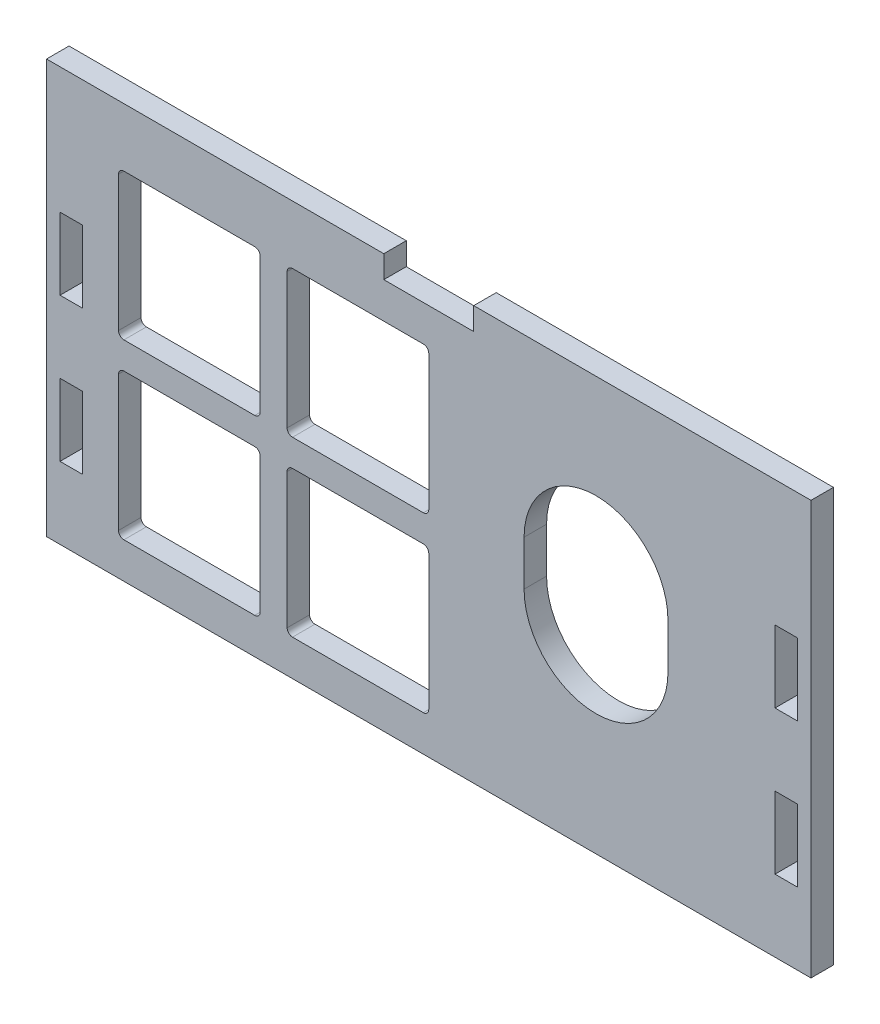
ISO-10303-21;
HEADER;
FILE_DESCRIPTION(('STEP AP214'),'2;1');
FILE_NAME('part.step','',(''),(''),'','','');
FILE_SCHEMA(('AUTOMOTIVE_DESIGN { 1 0 10303 214 1 1 1 1 }'));
ENDSEC;
DATA;
#1=APPLICATION_CONTEXT('core data for automotive mechanical design processes');
#2=APPLICATION_PROTOCOL_DEFINITION('international standard','automotive_design',2000,#1);
#3=PRODUCT_CONTEXT('',#1,'mechanical');
#4=PRODUCT('Part','Part','',(#3));
#5=PRODUCT_RELATED_PRODUCT_CATEGORY('part','',(#4));
#6=PRODUCT_DEFINITION_FORMATION('','',#4);
#7=PRODUCT_DEFINITION_CONTEXT('part definition',#1,'design');
#8=PRODUCT_DEFINITION('design','',#6,#7);
#9=PRODUCT_DEFINITION_SHAPE('','',#8);
#10=(LENGTH_UNIT() NAMED_UNIT(*) SI_UNIT(.MILLI.,.METRE.));
#11=(NAMED_UNIT(*) PLANE_ANGLE_UNIT() SI_UNIT($,.RADIAN.));
#12=(NAMED_UNIT(*) SI_UNIT($,.STERADIAN.) SOLID_ANGLE_UNIT());
#13=UNCERTAINTY_MEASURE_WITH_UNIT(LENGTH_MEASURE(1.E-05),#10,'distance_accuracy_value','');
#14=(GEOMETRIC_REPRESENTATION_CONTEXT(3) GLOBAL_UNCERTAINTY_ASSIGNED_CONTEXT((#13)) GLOBAL_UNIT_ASSIGNED_CONTEXT((#10,
#11,#12)) REPRESENTATION_CONTEXT('',''));
#15=CARTESIAN_POINT('',(0.,0.,0.));
#16=DIRECTION('',(0.,0.,1.));
#17=DIRECTION('',(1.,0.,0.));
#18=AXIS2_PLACEMENT_3D('',#15,#16,#17);
#19=CARTESIAN_POINT('',(-42.5,46.,2.5));
#20=DIRECTION('',(0.,-1.,0.));
#21=DIRECTION('',(0.,0.,-1.));
#22=AXIS2_PLACEMENT_3D('',#19,#20,#21);
#23=PLANE('',#22);
#24=DIRECTION('',(-1.,0.,0.));
#25=VECTOR('',#24,1.);
#26=CARTESIAN_POINT('',(-42.5,46.,0.));
#27=LINE('',#26,#25);
#28=CARTESIAN_POINT('',(42.5,46.,0.));
#29=VERTEX_POINT('',#28);
#30=CARTESIAN_POINT('',(5.,46.,0.));
#31=VERTEX_POINT('',#30);
#32=EDGE_CURVE('E854',#29,#31,#27,.T.);
#33=ORIENTED_EDGE('',*,*,#32,.T.);
#34=DIRECTION('',(0.,0.,1.));
#35=VECTOR('',#34,1.);
#36=CARTESIAN_POINT('',(5.,46.,-10.3077640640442));
#37=LINE('',#36,#35);
#38=CARTESIAN_POINT('',(5.,46.,2.5));
#39=VERTEX_POINT('',#38);
#40=EDGE_CURVE('E683',#31,#39,#37,.T.);
#41=ORIENTED_EDGE('',*,*,#40,.T.);
#42=DIRECTION('',(-1.,0.,0.));
#43=VECTOR('',#42,1.);
#44=CARTESIAN_POINT('',(-42.5,46.,2.5));
#45=LINE('',#44,#43);
#46=CARTESIAN_POINT('',(42.5,46.,2.5));
#47=VERTEX_POINT('',#46);
#48=EDGE_CURVE('E859',#47,#39,#45,.T.);
#49=ORIENTED_EDGE('',*,*,#48,.F.);
#50=DIRECTION('',(0.,0.,-1.));
#51=VECTOR('',#50,1.);
#52=CARTESIAN_POINT('',(42.5,46.,2.5));
#53=LINE('',#52,#51);
#54=EDGE_CURVE('E874',#47,#29,#53,.T.);
#55=ORIENTED_EDGE('',*,*,#54,.T.);
#56=EDGE_LOOP('',(#33,#41,#49,#55));
#57=FACE_BOUND('',#56,.T.);
#58=ADVANCED_FACE('F36',(#57),#23,.F.);
#59=CARTESIAN_POINT('',(-42.5,0.,2.5));
#60=DIRECTION('',(1.,0.,0.));
#61=DIRECTION('',(0.,0.,-1.));
#62=AXIS2_PLACEMENT_3D('',#59,#60,#61);
#63=PLANE('',#62);
#64=DIRECTION('',(0.,-1.,0.));
#65=VECTOR('',#64,1.);
#66=CARTESIAN_POINT('',(-42.5,0.,0.));
#67=LINE('',#66,#65);
#68=CARTESIAN_POINT('',(-42.5,46.,0.));
#69=VERTEX_POINT('',#68);
#70=CARTESIAN_POINT('',(-42.5,0.,0.));
#71=VERTEX_POINT('',#70);
#72=EDGE_CURVE('E849',#69,#71,#67,.T.);
#73=ORIENTED_EDGE('',*,*,#72,.T.);
#74=DIRECTION('',(0.,0.,-1.));
#75=VECTOR('',#74,1.);
#76=CARTESIAN_POINT('',(-42.5,0.,2.5));
#77=LINE('',#76,#75);
#78=CARTESIAN_POINT('',(-42.5,0.,2.5));
#79=VERTEX_POINT('',#78);
#80=EDGE_CURVE('E11',#79,#71,#77,.T.);
#81=ORIENTED_EDGE('',*,*,#80,.F.);
#82=DIRECTION('',(0.,-1.,0.));
#83=VECTOR('',#82,1.);
#84=CARTESIAN_POINT('',(-42.5,0.,2.5));
#85=LINE('',#84,#83);
#86=CARTESIAN_POINT('',(-42.5,46.,2.5));
#87=VERTEX_POINT('',#86);
#88=EDGE_CURVE('E850',#87,#79,#85,.T.);
#89=ORIENTED_EDGE('',*,*,#88,.F.);
#90=DIRECTION('',(0.,0.,-1.));
#91=VECTOR('',#90,1.);
#92=CARTESIAN_POINT('',(-42.5,46.,2.5));
#93=LINE('',#92,#91);
#94=EDGE_CURVE('E862',#87,#69,#93,.T.);
#95=ORIENTED_EDGE('',*,*,#94,.T.);
#96=EDGE_LOOP('',(#73,#81,#89,#95));
#97=FACE_BOUND('',#96,.T.);
#98=ADVANCED_FACE('F38',(#97),#63,.F.);
#99=CARTESIAN_POINT('',(-42.5,0.,2.5));
#100=DIRECTION('',(0.,1.,0.));
#101=DIRECTION('',(0.,0.,1.));
#102=AXIS2_PLACEMENT_3D('',#99,#100,#101);
#103=PLANE('',#102);
#104=DIRECTION('',(1.,0.,0.));
#105=VECTOR('',#104,1.);
#106=CARTESIAN_POINT('',(-42.5,0.,0.));
#107=LINE('',#106,#105);
#108=CARTESIAN_POINT('',(42.5,0.,0.));
#109=VERTEX_POINT('',#108);
#110=EDGE_CURVE('E865',#71,#109,#107,.T.);
#111=ORIENTED_EDGE('',*,*,#110,.T.);
#112=DIRECTION('',(0.,0.,-1.));
#113=VECTOR('',#112,1.);
#114=CARTESIAN_POINT('',(42.5,0.,2.5));
#115=LINE('',#114,#113);
#116=CARTESIAN_POINT('',(42.5,0.,2.5));
#117=VERTEX_POINT('',#116);
#118=EDGE_CURVE('E44',#117,#109,#115,.T.);
#119=ORIENTED_EDGE('',*,*,#118,.F.);
#120=DIRECTION('',(1.,0.,0.));
#121=VECTOR('',#120,1.);
#122=CARTESIAN_POINT('',(-42.5,0.,2.5));
#123=LINE('',#122,#121);
#124=EDGE_CURVE('E853',#79,#117,#123,.T.);
#125=ORIENTED_EDGE('',*,*,#124,.F.);
#126=ORIENTED_EDGE('',*,*,#80,.T.);
#127=EDGE_LOOP('',(#111,#119,#125,#126));
#128=FACE_BOUND('',#127,.T.);
#129=ADVANCED_FACE('F896',(#128),#103,.F.);
#130=CARTESIAN_POINT('',(42.5,0.,2.5));
#131=DIRECTION('',(-1.,0.,0.));
#132=DIRECTION('',(0.,0.,1.));
#133=AXIS2_PLACEMENT_3D('',#130,#131,#132);
#134=PLANE('',#133);
#135=DIRECTION('',(0.,1.,0.));
#136=VECTOR('',#135,1.);
#137=CARTESIAN_POINT('',(42.5,0.,0.));
#138=LINE('',#137,#136);
#139=EDGE_CURVE('E867',#109,#29,#138,.T.);
#140=ORIENTED_EDGE('',*,*,#139,.T.);
#141=ORIENTED_EDGE('',*,*,#54,.F.);
#142=DIRECTION('',(0.,1.,0.));
#143=VECTOR('',#142,1.);
#144=CARTESIAN_POINT('',(42.5,0.,2.5));
#145=LINE('',#144,#143);
#146=EDGE_CURVE('E856',#117,#47,#145,.T.);
#147=ORIENTED_EDGE('',*,*,#146,.F.);
#148=ORIENTED_EDGE('',*,*,#118,.T.);
#149=EDGE_LOOP('',(#140,#141,#147,#148));
#150=FACE_BOUND('',#149,.T.);
#151=ADVANCED_FACE('F881',(#150),#134,.F.);
#152=CARTESIAN_POINT('',(-5.,46.,2.5));
#153=VERTEX_POINT('',#152);
#154=EDGE_CURVE('E858',#153,#87,#45,.T.);
#155=ORIENTED_EDGE('',*,*,#154,.F.);
#156=DIRECTION('',(0.,0.,1.));
#157=VECTOR('',#156,1.);
#158=CARTESIAN_POINT('',(-5.,46.,-10.3077640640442));
#159=LINE('',#158,#157);
#160=CARTESIAN_POINT('',(-5.,46.,0.));
#161=VERTEX_POINT('',#160);
#162=EDGE_CURVE('E679',#161,#153,#159,.T.);
#163=ORIENTED_EDGE('',*,*,#162,.F.);
#164=EDGE_CURVE('E869',#161,#69,#27,.T.);
#165=ORIENTED_EDGE('',*,*,#164,.T.);
#166=ORIENTED_EDGE('',*,*,#94,.F.);
#167=EDGE_LOOP('',(#155,#163,#165,#166));
#168=FACE_BOUND('',#167,.T.);
#169=ADVANCED_FACE('F903',(#168),#23,.F.);
#170=CARTESIAN_POINT('',(0.,0.,2.5));
#171=DIRECTION('',(0.,0.,-1.));
#172=DIRECTION('',(-1.,0.,0.));
#173=AXIS2_PLACEMENT_3D('',#170,#171,#172);
#174=PLANE('',#173);
#175=CARTESIAN_POINT('',(-33.9,23.85,2.5));
#176=DIRECTION('',(0.,0.,1.));
#177=DIRECTION('',(1.,0.,0.));
#178=AXIS2_PLACEMENT_3D('',#175,#176,#177);
#179=CIRCLE('',#178,0.600000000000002);
#180=CARTESIAN_POINT('',(-34.5,23.85,2.5));
#181=VERTEX_POINT('',#180);
#182=CARTESIAN_POINT('',(-33.9,23.25,2.5));
#183=VERTEX_POINT('',#182);
#184=EDGE_CURVE('E1486',#181,#183,#179,.T.);
#185=ORIENTED_EDGE('',*,*,#184,.F.);
#186=DIRECTION('',(0.,-1.,0.));
#187=VECTOR('',#186,1.);
#188=CARTESIAN_POINT('',(-34.5,38.9,2.5));
#189=LINE('',#188,#187);
#190=CARTESIAN_POINT('',(-34.5,38.9,2.5));
#191=VERTEX_POINT('',#190);
#192=EDGE_CURVE('E432',#191,#181,#189,.T.);
#193=ORIENTED_EDGE('',*,*,#192,.F.);
#194=CARTESIAN_POINT('',(-33.9,38.9,2.5));
#195=DIRECTION('',(0.,0.,1.));
#196=DIRECTION('',(-1.,0.,0.));
#197=AXIS2_PLACEMENT_3D('',#194,#195,#196);
#198=CIRCLE('',#197,0.6);
#199=CARTESIAN_POINT('',(-33.9,39.5,2.5));
#200=VERTEX_POINT('',#199);
#201=EDGE_CURVE('E444',#200,#191,#198,.T.);
#202=ORIENTED_EDGE('',*,*,#201,.F.);
#203=DIRECTION('',(-1.,0.,0.));
#204=VECTOR('',#203,1.);
#205=CARTESIAN_POINT('',(-33.9,39.5,2.5));
#206=LINE('',#205,#204);
#207=CARTESIAN_POINT('',(-19.35,39.5,2.5));
#208=VERTEX_POINT('',#207);
#209=EDGE_CURVE('E51',#208,#200,#206,.T.);
#210=ORIENTED_EDGE('',*,*,#209,.F.);
#211=CARTESIAN_POINT('',(-19.35,38.9,2.5));
#212=DIRECTION('',(0.,0.,1.));
#213=DIRECTION('',(-1.,0.,0.));
#214=AXIS2_PLACEMENT_3D('',#211,#212,#213);
#215=CIRCLE('',#214,0.599999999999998);
#216=CARTESIAN_POINT('',(-18.75,38.9,2.5));
#217=VERTEX_POINT('',#216);
#218=EDGE_CURVE('E440',#217,#208,#215,.T.);
#219=ORIENTED_EDGE('',*,*,#218,.F.);
#220=DIRECTION('',(0.,1.,0.));
#221=VECTOR('',#220,1.);
#222=CARTESIAN_POINT('',(-18.75,38.9,2.5));
#223=LINE('',#222,#221);
#224=CARTESIAN_POINT('',(-18.75,23.85,2.5));
#225=VERTEX_POINT('',#224);
#226=EDGE_CURVE('E1495',#225,#217,#223,.T.);
#227=ORIENTED_EDGE('',*,*,#226,.F.);
#228=CARTESIAN_POINT('',(-19.35,23.85,2.5));
#229=DIRECTION('',(0.,0.,1.));
#230=DIRECTION('',(-1.,0.,0.));
#231=AXIS2_PLACEMENT_3D('',#228,#229,#230);
#232=CIRCLE('',#231,0.599999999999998);
#233=CARTESIAN_POINT('',(-19.35,23.25,2.5));
#234=VERTEX_POINT('',#233);
#235=EDGE_CURVE('E1492',#234,#225,#232,.T.);
#236=ORIENTED_EDGE('',*,*,#235,.F.);
#237=DIRECTION('',(1.,0.,0.));
#238=VECTOR('',#237,1.);
#239=CARTESIAN_POINT('',(-33.9,23.25,2.5));
#240=LINE('',#239,#238);
#241=EDGE_CURVE('E1487',#183,#234,#240,.T.);
#242=ORIENTED_EDGE('',*,*,#241,.F.);
#243=EDGE_LOOP('',(#185,#193,#202,#210,#219,#227,#236,#242));
#244=FACE_BOUND('',#243,.T.);
#245=CARTESIAN_POINT('',(-0.60000000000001,38.9,2.5));
#246=DIRECTION('',(0.,0.,1.));
#247=DIRECTION('',(1.,0.,0.));
#248=AXIS2_PLACEMENT_3D('',#245,#246,#247);
#249=CIRCLE('',#248,0.6);
#250=CARTESIAN_POINT('',(0.,38.9,2.5));
#251=VERTEX_POINT('',#250);
#252=CARTESIAN_POINT('',(-0.60000000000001,39.5,2.5));
#253=VERTEX_POINT('',#252);
#254=EDGE_CURVE('E488',#251,#253,#249,.T.);
#255=ORIENTED_EDGE('',*,*,#254,.F.);
#256=DIRECTION('',(0.,1.,0.));
#257=VECTOR('',#256,1.);
#258=CARTESIAN_POINT('',(0.,38.9,2.5));
#259=LINE('',#258,#257);
#260=CARTESIAN_POINT('',(0.,23.85,2.5));
#261=VERTEX_POINT('',#260);
#262=EDGE_CURVE('E491',#261,#251,#259,.T.);
#263=ORIENTED_EDGE('',*,*,#262,.F.);
#264=CARTESIAN_POINT('',(-0.600000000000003,23.85,2.5));
#265=DIRECTION('',(0.,0.,1.));
#266=DIRECTION('',(-1.,0.,0.));
#267=AXIS2_PLACEMENT_3D('',#264,#265,#266);
#268=CIRCLE('',#267,0.600000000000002);
#269=CARTESIAN_POINT('',(-0.600000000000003,23.25,2.5));
#270=VERTEX_POINT('',#269);
#271=EDGE_CURVE('E494',#270,#261,#268,.T.);
#272=ORIENTED_EDGE('',*,*,#271,.F.);
#273=DIRECTION('',(1.,0.,0.));
#274=VECTOR('',#273,1.);
#275=CARTESIAN_POINT('',(-0.600000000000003,23.25,2.5));
#276=LINE('',#275,#274);
#277=CARTESIAN_POINT('',(-15.15,23.25,2.5));
#278=VERTEX_POINT('',#277);
#279=EDGE_CURVE('E59',#278,#270,#276,.T.);
#280=ORIENTED_EDGE('',*,*,#279,.F.);
#281=CARTESIAN_POINT('',(-15.15,23.85,2.5));
#282=DIRECTION('',(0.,0.,1.));
#283=DIRECTION('',(1.,0.,0.));
#284=AXIS2_PLACEMENT_3D('',#281,#282,#283);
#285=CIRCLE('',#284,0.599999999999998);
#286=CARTESIAN_POINT('',(-15.75,23.85,2.5));
#287=VERTEX_POINT('',#286);
#288=EDGE_CURVE('E476',#287,#278,#285,.T.);
#289=ORIENTED_EDGE('',*,*,#288,.F.);
#290=DIRECTION('',(0.,-1.,0.));
#291=VECTOR('',#290,1.);
#292=CARTESIAN_POINT('',(-15.75,38.9,2.5));
#293=LINE('',#292,#291);
#294=CARTESIAN_POINT('',(-15.75,38.9,2.5));
#295=VERTEX_POINT('',#294);
#296=EDGE_CURVE('E479',#295,#287,#293,.T.);
#297=ORIENTED_EDGE('',*,*,#296,.F.);
#298=CARTESIAN_POINT('',(-15.15,38.9,2.5));
#299=DIRECTION('',(0.,0.,1.));
#300=DIRECTION('',(1.,0.,0.));
#301=AXIS2_PLACEMENT_3D('',#298,#299,#300);
#302=CIRCLE('',#301,0.599999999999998);
#303=CARTESIAN_POINT('',(-15.15,39.5,2.5));
#304=VERTEX_POINT('',#303);
#305=EDGE_CURVE('E482',#304,#295,#302,.T.);
#306=ORIENTED_EDGE('',*,*,#305,.F.);
#307=DIRECTION('',(-1.,0.,0.));
#308=VECTOR('',#307,1.);
#309=CARTESIAN_POINT('',(-0.60000000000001,39.5,2.5));
#310=LINE('',#309,#308);
#311=EDGE_CURVE('E485',#253,#304,#310,.T.);
#312=ORIENTED_EDGE('',*,*,#311,.F.);
#313=EDGE_LOOP('',(#255,#263,#272,#280,#289,#297,#306,#312));
#314=FACE_BOUND('',#313,.T.);
#315=CARTESIAN_POINT('',(-0.600000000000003,19.65,2.5));
#316=DIRECTION('',(0.,0.,1.));
#317=DIRECTION('',(1.,0.,0.));
#318=AXIS2_PLACEMENT_3D('',#315,#316,#317);
#319=CIRCLE('',#318,0.600000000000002);
#320=CARTESIAN_POINT('',(0.,19.65,2.5));
#321=VERTEX_POINT('',#320);
#322=CARTESIAN_POINT('',(-0.600000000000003,20.25,2.5));
#323=VERTEX_POINT('',#322);
#324=EDGE_CURVE('E552',#321,#323,#319,.T.);
#325=ORIENTED_EDGE('',*,*,#324,.F.);
#326=DIRECTION('',(0.,1.,0.));
#327=VECTOR('',#326,1.);
#328=CARTESIAN_POINT('',(0.,4.6,2.5));
#329=LINE('',#328,#327);
#330=CARTESIAN_POINT('',(0.,4.6,2.5));
#331=VERTEX_POINT('',#330);
#332=EDGE_CURVE('E555',#331,#321,#329,.T.);
#333=ORIENTED_EDGE('',*,*,#332,.F.);
#334=CARTESIAN_POINT('',(-0.599999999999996,4.6,2.5));
#335=DIRECTION('',(0.,0.,1.));
#336=DIRECTION('',(-1.,0.,0.));
#337=AXIS2_PLACEMENT_3D('',#334,#335,#336);
#338=CIRCLE('',#337,0.600000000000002);
#339=CARTESIAN_POINT('',(-0.599999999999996,4.,2.5));
#340=VERTEX_POINT('',#339);
#341=EDGE_CURVE('E558',#340,#331,#338,.T.);
#342=ORIENTED_EDGE('',*,*,#341,.F.);
#343=DIRECTION('',(1.,0.,0.));
#344=VECTOR('',#343,1.);
#345=CARTESIAN_POINT('',(-0.599999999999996,4.,2.5));
#346=LINE('',#345,#344);
#347=CARTESIAN_POINT('',(-15.15,4.,2.5));
#348=VERTEX_POINT('',#347);
#349=EDGE_CURVE('E537',#348,#340,#346,.T.);
#350=ORIENTED_EDGE('',*,*,#349,.F.);
#351=CARTESIAN_POINT('',(-15.15,4.6,2.5));
#352=DIRECTION('',(0.,0.,1.));
#353=DIRECTION('',(-1.,0.,0.));
#354=AXIS2_PLACEMENT_3D('',#351,#352,#353);
#355=CIRCLE('',#354,0.599999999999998);
#356=CARTESIAN_POINT('',(-15.75,4.6,2.5));
#357=VERTEX_POINT('',#356);
#358=EDGE_CURVE('E540',#357,#348,#355,.T.);
#359=ORIENTED_EDGE('',*,*,#358,.F.);
#360=DIRECTION('',(0.,-1.,0.));
#361=VECTOR('',#360,1.);
#362=CARTESIAN_POINT('',(-15.75,4.6,2.5));
#363=LINE('',#362,#361);
#364=CARTESIAN_POINT('',(-15.75,19.65,2.5));
#365=VERTEX_POINT('',#364);
#366=EDGE_CURVE('E543',#365,#357,#363,.T.);
#367=ORIENTED_EDGE('',*,*,#366,.F.);
#368=CARTESIAN_POINT('',(-15.15,19.65,2.5));
#369=DIRECTION('',(0.,0.,1.));
#370=DIRECTION('',(-1.,0.,0.));
#371=AXIS2_PLACEMENT_3D('',#368,#369,#370);
#372=CIRCLE('',#371,0.599999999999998);
#373=CARTESIAN_POINT('',(-15.15,20.25,2.5));
#374=VERTEX_POINT('',#373);
#375=EDGE_CURVE('E546',#374,#365,#372,.T.);
#376=ORIENTED_EDGE('',*,*,#375,.F.);
#377=DIRECTION('',(-1.,0.,0.));
#378=VECTOR('',#377,1.);
#379=CARTESIAN_POINT('',(-0.600000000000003,20.25,2.5));
#380=LINE('',#379,#378);
#381=EDGE_CURVE('E549',#323,#374,#380,.T.);
#382=ORIENTED_EDGE('',*,*,#381,.F.);
#383=EDGE_LOOP('',(#325,#333,#342,#350,#359,#367,#376,#382));
#384=FACE_BOUND('',#383,.T.);
#385=CARTESIAN_POINT('',(-33.9,4.6,2.5));
#386=DIRECTION('',(0.,0.,1.));
#387=DIRECTION('',(1.,0.,0.));
#388=AXIS2_PLACEMENT_3D('',#385,#386,#387);
#389=CIRCLE('',#388,0.600000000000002);
#390=CARTESIAN_POINT('',(-34.5,4.6,2.5));
#391=VERTEX_POINT('',#390);
#392=CARTESIAN_POINT('',(-33.9,4.,2.5));
#393=VERTEX_POINT('',#392);
#394=EDGE_CURVE('E615',#391,#393,#389,.T.);
#395=ORIENTED_EDGE('',*,*,#394,.F.);
#396=DIRECTION('',(0.,-1.,0.));
#397=VECTOR('',#396,1.);
#398=CARTESIAN_POINT('',(-34.5,4.6,2.5));
#399=LINE('',#398,#397);
#400=CARTESIAN_POINT('',(-34.5,19.65,2.5));
#401=VERTEX_POINT('',#400);
#402=EDGE_CURVE('E618',#401,#391,#399,.T.);
#403=ORIENTED_EDGE('',*,*,#402,.F.);
#404=CARTESIAN_POINT('',(-33.9,19.65,2.5));
#405=DIRECTION('',(0.,0.,1.));
#406=DIRECTION('',(-1.,0.,0.));
#407=AXIS2_PLACEMENT_3D('',#404,#405,#406);
#408=CIRCLE('',#407,0.600000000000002);
#409=CARTESIAN_POINT('',(-33.9,20.25,2.5));
#410=VERTEX_POINT('',#409);
#411=EDGE_CURVE('E473',#410,#401,#408,.T.);
#412=ORIENTED_EDGE('',*,*,#411,.F.);
#413=DIRECTION('',(-1.,0.,0.));
#414=VECTOR('',#413,1.);
#415=CARTESIAN_POINT('',(-33.9,20.25,2.5));
#416=LINE('',#415,#414);
#417=CARTESIAN_POINT('',(-19.35,20.25,2.5));
#418=VERTEX_POINT('',#417);
#419=EDGE_CURVE('E600',#418,#410,#416,.T.);
#420=ORIENTED_EDGE('',*,*,#419,.F.);
#421=CARTESIAN_POINT('',(-19.35,19.65,2.5));
#422=DIRECTION('',(0.,0.,1.));
#423=DIRECTION('',(1.,0.,0.));
#424=AXIS2_PLACEMENT_3D('',#421,#422,#423);
#425=CIRCLE('',#424,0.599999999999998);
#426=CARTESIAN_POINT('',(-18.75,19.65,2.5));
#427=VERTEX_POINT('',#426);
#428=EDGE_CURVE('E603',#427,#418,#425,.T.);
#429=ORIENTED_EDGE('',*,*,#428,.F.);
#430=DIRECTION('',(0.,1.,0.));
#431=VECTOR('',#430,1.);
#432=CARTESIAN_POINT('',(-18.75,4.6,2.5));
#433=LINE('',#432,#431);
#434=CARTESIAN_POINT('',(-18.75,4.6,2.5));
#435=VERTEX_POINT('',#434);
#436=EDGE_CURVE('E606',#435,#427,#433,.T.);
#437=ORIENTED_EDGE('',*,*,#436,.F.);
#438=CARTESIAN_POINT('',(-19.35,4.6,2.5));
#439=DIRECTION('',(0.,0.,1.));
#440=DIRECTION('',(1.,0.,0.));
#441=AXIS2_PLACEMENT_3D('',#438,#439,#440);
#442=CIRCLE('',#441,0.6);
#443=CARTESIAN_POINT('',(-19.35,4.,2.5));
#444=VERTEX_POINT('',#443);
#445=EDGE_CURVE('E609',#444,#435,#442,.T.);
#446=ORIENTED_EDGE('',*,*,#445,.F.);
#447=DIRECTION('',(1.,0.,0.));
#448=VECTOR('',#447,1.);
#449=CARTESIAN_POINT('',(-33.9,4.,2.5));
#450=LINE('',#449,#448);
#451=EDGE_CURVE('E612',#393,#444,#450,.T.);
#452=ORIENTED_EDGE('',*,*,#451,.F.);
#453=EDGE_LOOP('',(#395,#403,#412,#420,#429,#437,#446,#452));
#454=FACE_BOUND('',#453,.T.);
#455=CARTESIAN_POINT('',(18.6,21.5,2.5));
#456=DIRECTION('',(0.,0.,1.));
#457=DIRECTION('',(1.,0.,0.));
#458=AXIS2_PLACEMENT_3D('',#455,#456,#457);
#459=CIRCLE('',#458,8.);
#460=CARTESIAN_POINT('',(10.6,21.5,2.5));
#461=VERTEX_POINT('',#460);
#462=CARTESIAN_POINT('',(26.6,21.5,2.5));
#463=VERTEX_POINT('',#462);
#464=EDGE_CURVE('E693',#461,#463,#459,.T.);
#465=ORIENTED_EDGE('',*,*,#464,.F.);
#466=DIRECTION('',(0.,-1.,0.));
#467=VECTOR('',#466,1.);
#468=CARTESIAN_POINT('',(10.6,26.5,2.5));
#469=LINE('',#468,#467);
#470=CARTESIAN_POINT('',(10.6,26.5,2.5));
#471=VERTEX_POINT('',#470);
#472=EDGE_CURVE('E696',#471,#461,#469,.T.);
#473=ORIENTED_EDGE('',*,*,#472,.F.);
#474=CARTESIAN_POINT('',(18.6,26.5,2.5));
#475=DIRECTION('',(0.,0.,1.));
#476=DIRECTION('',(1.,0.,0.));
#477=AXIS2_PLACEMENT_3D('',#474,#475,#476);
#478=CIRCLE('',#477,8.);
#479=CARTESIAN_POINT('',(26.6,26.5,2.5));
#480=VERTEX_POINT('',#479);
#481=EDGE_CURVE('E689',#480,#471,#478,.T.);
#482=ORIENTED_EDGE('',*,*,#481,.F.);
#483=DIRECTION('',(0.,1.,0.));
#484=VECTOR('',#483,1.);
#485=CARTESIAN_POINT('',(26.6,26.5,2.5));
#486=LINE('',#485,#484);
#487=EDGE_CURVE('E690',#463,#480,#486,.T.);
#488=ORIENTED_EDGE('',*,*,#487,.F.);
#489=EDGE_LOOP('',(#465,#473,#482,#488));
#490=FACE_BOUND('',#489,.T.);
#491=DIRECTION('',(0.,1.,0.));
#492=VECTOR('',#491,1.);
#493=CARTESIAN_POINT('',(41.,16.,2.5));
#494=LINE('',#493,#492);
#495=CARTESIAN_POINT('',(41.,8.,2.5));
#496=VERTEX_POINT('',#495);
#497=CARTESIAN_POINT('',(41.,16.,2.5));
#498=VERTEX_POINT('',#497);
#499=EDGE_CURVE('E725',#496,#498,#494,.T.);
#500=ORIENTED_EDGE('',*,*,#499,.F.);
#501=DIRECTION('',(1.,0.,0.));
#502=VECTOR('',#501,1.);
#503=CARTESIAN_POINT('',(38.5,8.,2.5));
#504=LINE('',#503,#502);
#505=CARTESIAN_POINT('',(38.5,8.,2.5));
#506=VERTEX_POINT('',#505);
#507=EDGE_CURVE('E728',#506,#496,#504,.T.);
#508=ORIENTED_EDGE('',*,*,#507,.F.);
#509=DIRECTION('',(0.,-1.,0.));
#510=VECTOR('',#509,1.);
#511=CARTESIAN_POINT('',(38.5,16.,2.5));
#512=LINE('',#511,#510);
#513=CARTESIAN_POINT('',(38.5,16.,2.5));
#514=VERTEX_POINT('',#513);
#515=EDGE_CURVE('E731',#514,#506,#512,.T.);
#516=ORIENTED_EDGE('',*,*,#515,.F.);
#517=DIRECTION('',(-1.,0.,0.));
#518=VECTOR('',#517,1.);
#519=CARTESIAN_POINT('',(38.5,16.,2.5));
#520=LINE('',#519,#518);
#521=EDGE_CURVE('E722',#498,#514,#520,.T.);
#522=ORIENTED_EDGE('',*,*,#521,.F.);
#523=EDGE_LOOP('',(#500,#508,#516,#522));
#524=FACE_BOUND('',#523,.T.);
#525=DIRECTION('',(1.,0.,0.));
#526=VECTOR('',#525,1.);
#527=CARTESIAN_POINT('',(-38.5,8.,2.5));
#528=LINE('',#527,#526);
#529=CARTESIAN_POINT('',(-41.,8.,2.5));
#530=VERTEX_POINT('',#529);
#531=CARTESIAN_POINT('',(-38.5,8.,2.5));
#532=VERTEX_POINT('',#531);
#533=EDGE_CURVE('E759',#530,#532,#528,.T.);
#534=ORIENTED_EDGE('',*,*,#533,.F.);
#535=DIRECTION('',(0.,-1.,0.));
#536=VECTOR('',#535,1.);
#537=CARTESIAN_POINT('',(-41.,16.,2.5));
#538=LINE('',#537,#536);
#539=CARTESIAN_POINT('',(-41.,16.,2.5));
#540=VERTEX_POINT('',#539);
#541=EDGE_CURVE('E762',#540,#530,#538,.T.);
#542=ORIENTED_EDGE('',*,*,#541,.F.);
#543=DIRECTION('',(-1.,0.,0.));
#544=VECTOR('',#543,1.);
#545=CARTESIAN_POINT('',(-38.5,16.,2.5));
#546=LINE('',#545,#544);
#547=CARTESIAN_POINT('',(-38.5,16.,2.5));
#548=VERTEX_POINT('',#547);
#549=EDGE_CURVE('E765',#548,#540,#546,.T.);
#550=ORIENTED_EDGE('',*,*,#549,.F.);
#551=DIRECTION('',(0.,1.,0.));
#552=VECTOR('',#551,1.);
#553=CARTESIAN_POINT('',(-38.5,16.,2.5));
#554=LINE('',#553,#552);
#555=EDGE_CURVE('E756',#532,#548,#554,.T.);
#556=ORIENTED_EDGE('',*,*,#555,.F.);
#557=EDGE_LOOP('',(#534,#542,#550,#556));
#558=FACE_BOUND('',#557,.T.);
#559=DIRECTION('',(1.,0.,0.));
#560=VECTOR('',#559,1.);
#561=CARTESIAN_POINT('',(-38.5,24.,2.5));
#562=LINE('',#561,#560);
#563=CARTESIAN_POINT('',(-41.,24.,2.5));
#564=VERTEX_POINT('',#563);
#565=CARTESIAN_POINT('',(-38.5,24.,2.5));
#566=VERTEX_POINT('',#565);
#567=EDGE_CURVE('E791',#564,#566,#562,.T.);
#568=ORIENTED_EDGE('',*,*,#567,.F.);
#569=DIRECTION('',(0.,-1.,0.));
#570=VECTOR('',#569,1.);
#571=CARTESIAN_POINT('',(-41.,32.,2.5));
#572=LINE('',#571,#570);
#573=CARTESIAN_POINT('',(-41.,32.,2.5));
#574=VERTEX_POINT('',#573);
#575=EDGE_CURVE('E794',#574,#564,#572,.T.);
#576=ORIENTED_EDGE('',*,*,#575,.F.);
#577=DIRECTION('',(-1.,0.,0.));
#578=VECTOR('',#577,1.);
#579=CARTESIAN_POINT('',(-38.5,32.,2.5));
#580=LINE('',#579,#578);
#581=CARTESIAN_POINT('',(-38.5,32.,2.5));
#582=VERTEX_POINT('',#581);
#583=EDGE_CURVE('E721',#582,#574,#580,.T.);
#584=ORIENTED_EDGE('',*,*,#583,.F.);
#585=DIRECTION('',(0.,1.,0.));
#586=VECTOR('',#585,1.);
#587=CARTESIAN_POINT('',(-38.5,32.,2.5));
#588=LINE('',#587,#586);
#589=EDGE_CURVE('E788',#566,#582,#588,.T.);
#590=ORIENTED_EDGE('',*,*,#589,.F.);
#591=EDGE_LOOP('',(#568,#576,#584,#590));
#592=FACE_BOUND('',#591,.T.);
#593=DIRECTION('',(0.,1.,0.));
#594=VECTOR('',#593,1.);
#595=CARTESIAN_POINT('',(41.,32.,2.5));
#596=LINE('',#595,#594);
#597=CARTESIAN_POINT('',(41.,24.,2.5));
#598=VERTEX_POINT('',#597);
#599=CARTESIAN_POINT('',(41.,32.,2.5));
#600=VERTEX_POINT('',#599);
#601=EDGE_CURVE('E821',#598,#600,#596,.T.);
#602=ORIENTED_EDGE('',*,*,#601,.F.);
#603=DIRECTION('',(1.,0.,0.));
#604=VECTOR('',#603,1.);
#605=CARTESIAN_POINT('',(38.5,24.,2.5));
#606=LINE('',#605,#604);
#607=CARTESIAN_POINT('',(38.5,24.,2.5));
#608=VERTEX_POINT('',#607);
#609=EDGE_CURVE('E824',#608,#598,#606,.T.);
#610=ORIENTED_EDGE('',*,*,#609,.F.);
#611=DIRECTION('',(0.,-1.,0.));
#612=VECTOR('',#611,1.);
#613=CARTESIAN_POINT('',(38.5,32.,2.5));
#614=LINE('',#613,#612);
#615=CARTESIAN_POINT('',(38.5,32.,2.5));
#616=VERTEX_POINT('',#615);
#617=EDGE_CURVE('E755',#616,#608,#614,.T.);
#618=ORIENTED_EDGE('',*,*,#617,.F.);
#619=DIRECTION('',(-1.,0.,0.));
#620=VECTOR('',#619,1.);
#621=CARTESIAN_POINT('',(38.5,32.,2.5));
#622=LINE('',#621,#620);
#623=EDGE_CURVE('E818',#600,#616,#622,.T.);
#624=ORIENTED_EDGE('',*,*,#623,.F.);
#625=EDGE_LOOP('',(#602,#610,#618,#624));
#626=FACE_BOUND('',#625,.T.);
#627=ORIENTED_EDGE('',*,*,#48,.T.);
#628=DIRECTION('',(0.,1.,0.));
#629=VECTOR('',#628,1.);
#630=CARTESIAN_POINT('',(5.,46.,2.5));
#631=LINE('',#630,#629);
#632=CARTESIAN_POINT('',(5.,43.5,2.5));
#633=VERTEX_POINT('',#632);
#634=EDGE_CURVE('E664',#633,#39,#631,.T.);
#635=ORIENTED_EDGE('',*,*,#634,.F.);
#636=DIRECTION('',(1.,0.,0.));
#637=VECTOR('',#636,1.);
#638=CARTESIAN_POINT('',(-5.,43.5,2.5));
#639=LINE('',#638,#637);
#640=CARTESIAN_POINT('',(-5.,43.5,2.5));
#641=VERTEX_POINT('',#640);
#642=EDGE_CURVE('E667',#641,#633,#639,.T.);
#643=ORIENTED_EDGE('',*,*,#642,.F.);
#644=DIRECTION('',(0.,-1.,0.));
#645=VECTOR('',#644,1.);
#646=CARTESIAN_POINT('',(-5.,46.,2.5));
#647=LINE('',#646,#645);
#648=EDGE_CURVE('E663',#153,#641,#647,.T.);
#649=ORIENTED_EDGE('',*,*,#648,.F.);
#650=ORIENTED_EDGE('',*,*,#154,.T.);
#651=ORIENTED_EDGE('',*,*,#88,.T.);
#652=ORIENTED_EDGE('',*,*,#124,.T.);
#653=ORIENTED_EDGE('',*,*,#146,.T.);
#654=EDGE_LOOP('',(#627,#635,#643,#649,#650,#651,#652,#653));
#655=FACE_BOUND('',#654,.T.);
#656=ADVANCED_FACE('F892',(#244,#314,#384,#454,#490,#524,#558,#592,#626,#655),#174,.F.);
#657=CARTESIAN_POINT('',(0.,0.,0.));
#658=DIRECTION('',(0.,0.,-1.));
#659=DIRECTION('',(-1.,0.,0.));
#660=AXIS2_PLACEMENT_3D('',#657,#658,#659);
#661=PLANE('',#660);
#662=DIRECTION('',(0.,-1.,0.));
#663=VECTOR('',#662,1.);
#664=CARTESIAN_POINT('',(-34.5,38.9,0.));
#665=LINE('',#664,#663);
#666=CARTESIAN_POINT('',(-34.5,38.9,0.));
#667=VERTEX_POINT('',#666);
#668=CARTESIAN_POINT('',(-34.5,23.85,0.));
#669=VERTEX_POINT('',#668);
#670=EDGE_CURVE('E429',#667,#669,#665,.T.);
#671=ORIENTED_EDGE('',*,*,#670,.T.);
#672=CARTESIAN_POINT('',(-33.9,23.85,0.));
#673=DIRECTION('',(0.,0.,-1.));
#674=DIRECTION('',(-1.,0.,0.));
#675=AXIS2_PLACEMENT_3D('',#672,#673,#674);
#676=CIRCLE('',#675,0.600000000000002);
#677=CARTESIAN_POINT('',(-33.9,23.25,0.));
#678=VERTEX_POINT('',#677);
#679=EDGE_CURVE('E415',#669,#678,#676,.F.);
#680=ORIENTED_EDGE('',*,*,#679,.T.);
#681=DIRECTION('',(1.,0.,0.));
#682=VECTOR('',#681,1.);
#683=CARTESIAN_POINT('',(-33.9,23.25,0.));
#684=LINE('',#683,#682);
#685=CARTESIAN_POINT('',(-19.35,23.25,0.));
#686=VERTEX_POINT('',#685);
#687=EDGE_CURVE('E464',#678,#686,#684,.T.);
#688=ORIENTED_EDGE('',*,*,#687,.T.);
#689=CARTESIAN_POINT('',(-19.35,23.85,0.));
#690=DIRECTION('',(0.,0.,-1.));
#691=DIRECTION('',(-1.,0.,0.));
#692=AXIS2_PLACEMENT_3D('',#689,#690,#691);
#693=CIRCLE('',#692,0.599999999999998);
#694=CARTESIAN_POINT('',(-18.75,23.85,0.));
#695=VERTEX_POINT('',#694);
#696=EDGE_CURVE('E460',#686,#695,#693,.F.);
#697=ORIENTED_EDGE('',*,*,#696,.T.);
#698=DIRECTION('',(0.,1.,0.));
#699=VECTOR('',#698,1.);
#700=CARTESIAN_POINT('',(-18.75,38.9,0.));
#701=LINE('',#700,#699);
#702=CARTESIAN_POINT('',(-18.75,38.9,0.));
#703=VERTEX_POINT('',#702);
#704=EDGE_CURVE('E456',#695,#703,#701,.T.);
#705=ORIENTED_EDGE('',*,*,#704,.T.);
#706=CARTESIAN_POINT('',(-19.35,38.9,0.));
#707=DIRECTION('',(0.,0.,-1.));
#708=DIRECTION('',(-1.,0.,0.));
#709=AXIS2_PLACEMENT_3D('',#706,#707,#708);
#710=CIRCLE('',#709,0.599999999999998);
#711=CARTESIAN_POINT('',(-19.35,39.5,0.));
#712=VERTEX_POINT('',#711);
#713=EDGE_CURVE('E452',#703,#712,#710,.F.);
#714=ORIENTED_EDGE('',*,*,#713,.T.);
#715=DIRECTION('',(-1.,0.,0.));
#716=VECTOR('',#715,1.);
#717=CARTESIAN_POINT('',(-33.9,39.5,0.));
#718=LINE('',#717,#716);
#719=CARTESIAN_POINT('',(-33.9,39.5,0.));
#720=VERTEX_POINT('',#719);
#721=EDGE_CURVE('E449',#712,#720,#718,.T.);
#722=ORIENTED_EDGE('',*,*,#721,.T.);
#723=CARTESIAN_POINT('',(-33.9,38.9,0.));
#724=DIRECTION('',(0.,0.,-1.));
#725=DIRECTION('',(-1.,0.,0.));
#726=AXIS2_PLACEMENT_3D('',#723,#724,#725);
#727=CIRCLE('',#726,0.6);
#728=EDGE_CURVE('E438',#720,#667,#727,.F.);
#729=ORIENTED_EDGE('',*,*,#728,.T.);
#730=EDGE_LOOP('',(#671,#680,#688,#697,#705,#714,#722,#729));
#731=FACE_BOUND('',#730,.T.);
#732=DIRECTION('',(0.,1.,0.));
#733=VECTOR('',#732,1.);
#734=CARTESIAN_POINT('',(0.,38.9,0.));
#735=LINE('',#734,#733);
#736=CARTESIAN_POINT('',(0.,23.85,0.));
#737=VERTEX_POINT('',#736);
#738=CARTESIAN_POINT('',(0.,38.9,0.));
#739=VERTEX_POINT('',#738);
#740=EDGE_CURVE('E475',#737,#739,#735,.T.);
#741=ORIENTED_EDGE('',*,*,#740,.T.);
#742=CARTESIAN_POINT('',(-0.60000000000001,38.9,0.));
#743=DIRECTION('',(0.,0.,-1.));
#744=DIRECTION('',(-1.,0.,0.));
#745=AXIS2_PLACEMENT_3D('',#742,#743,#744);
#746=CIRCLE('',#745,0.6);
#747=CARTESIAN_POINT('',(-0.60000000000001,39.5,0.));
#748=VERTEX_POINT('',#747);
#749=EDGE_CURVE('E526',#739,#748,#746,.F.);
#750=ORIENTED_EDGE('',*,*,#749,.T.);
#751=DIRECTION('',(-1.,0.,0.));
#752=VECTOR('',#751,1.);
#753=CARTESIAN_POINT('',(-0.60000000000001,39.5,0.));
#754=LINE('',#753,#752);
#755=CARTESIAN_POINT('',(-15.15,39.5,0.));
#756=VERTEX_POINT('',#755);
#757=EDGE_CURVE('E522',#748,#756,#754,.T.);
#758=ORIENTED_EDGE('',*,*,#757,.T.);
#759=CARTESIAN_POINT('',(-15.15,38.9,0.));
#760=DIRECTION('',(0.,0.,-1.));
#761=DIRECTION('',(-1.,0.,0.));
#762=AXIS2_PLACEMENT_3D('',#759,#760,#761);
#763=CIRCLE('',#762,0.599999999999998);
#764=CARTESIAN_POINT('',(-15.75,38.9,0.));
#765=VERTEX_POINT('',#764);
#766=EDGE_CURVE('E518',#756,#765,#763,.F.);
#767=ORIENTED_EDGE('',*,*,#766,.T.);
#768=DIRECTION('',(0.,-1.,0.));
#769=VECTOR('',#768,1.);
#770=CARTESIAN_POINT('',(-15.75,38.9,0.));
#771=LINE('',#770,#769);
#772=CARTESIAN_POINT('',(-15.75,23.85,0.));
#773=VERTEX_POINT('',#772);
#774=EDGE_CURVE('E514',#765,#773,#771,.T.);
#775=ORIENTED_EDGE('',*,*,#774,.T.);
#776=CARTESIAN_POINT('',(-15.15,23.85,0.));
#777=DIRECTION('',(0.,0.,-1.));
#778=DIRECTION('',(-1.,0.,0.));
#779=AXIS2_PLACEMENT_3D('',#776,#777,#778);
#780=CIRCLE('',#779,0.599999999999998);
#781=CARTESIAN_POINT('',(-15.15,23.25,0.));
#782=VERTEX_POINT('',#781);
#783=EDGE_CURVE('E510',#773,#782,#780,.F.);
#784=ORIENTED_EDGE('',*,*,#783,.T.);
#785=DIRECTION('',(1.,0.,0.));
#786=VECTOR('',#785,1.);
#787=CARTESIAN_POINT('',(-0.600000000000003,23.25,0.));
#788=LINE('',#787,#786);
#789=CARTESIAN_POINT('',(-0.600000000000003,23.25,0.));
#790=VERTEX_POINT('',#789);
#791=EDGE_CURVE('E506',#782,#790,#788,.T.);
#792=ORIENTED_EDGE('',*,*,#791,.T.);
#793=CARTESIAN_POINT('',(-0.600000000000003,23.85,0.));
#794=DIRECTION('',(0.,0.,-1.));
#795=DIRECTION('',(-1.,0.,0.));
#796=AXIS2_PLACEMENT_3D('',#793,#794,#795);
#797=CIRCLE('',#796,0.600000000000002);
#798=EDGE_CURVE('E501',#790,#737,#797,.F.);
#799=ORIENTED_EDGE('',*,*,#798,.T.);
#800=EDGE_LOOP('',(#741,#750,#758,#767,#775,#784,#792,#799));
#801=FACE_BOUND('',#800,.T.);
#802=DIRECTION('',(0.,1.,0.));
#803=VECTOR('',#802,1.);
#804=CARTESIAN_POINT('',(0.,4.6,0.));
#805=LINE('',#804,#803);
#806=CARTESIAN_POINT('',(0.,4.6,0.));
#807=VERTEX_POINT('',#806);
#808=CARTESIAN_POINT('',(0.,19.65,0.));
#809=VERTEX_POINT('',#808);
#810=EDGE_CURVE('E539',#807,#809,#805,.T.);
#811=ORIENTED_EDGE('',*,*,#810,.T.);
#812=CARTESIAN_POINT('',(-0.600000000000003,19.65,0.));
#813=DIRECTION('',(0.,0.,-1.));
#814=DIRECTION('',(-1.,0.,0.));
#815=AXIS2_PLACEMENT_3D('',#812,#813,#814);
#816=CIRCLE('',#815,0.600000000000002);
#817=CARTESIAN_POINT('',(-0.600000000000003,20.25,0.));
#818=VERTEX_POINT('',#817);
#819=EDGE_CURVE('E588',#809,#818,#816,.F.);
#820=ORIENTED_EDGE('',*,*,#819,.T.);
#821=DIRECTION('',(-1.,0.,0.));
#822=VECTOR('',#821,1.);
#823=CARTESIAN_POINT('',(-0.600000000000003,20.25,0.));
#824=LINE('',#823,#822);
#825=CARTESIAN_POINT('',(-15.15,20.25,0.));
#826=VERTEX_POINT('',#825);
#827=EDGE_CURVE('E584',#818,#826,#824,.T.);
#828=ORIENTED_EDGE('',*,*,#827,.T.);
#829=CARTESIAN_POINT('',(-15.15,19.65,0.));
#830=DIRECTION('',(0.,0.,-1.));
#831=DIRECTION('',(-1.,0.,0.));
#832=AXIS2_PLACEMENT_3D('',#829,#830,#831);
#833=CIRCLE('',#832,0.599999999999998);
#834=CARTESIAN_POINT('',(-15.75,19.65,0.));
#835=VERTEX_POINT('',#834);
#836=EDGE_CURVE('E580',#826,#835,#833,.F.);
#837=ORIENTED_EDGE('',*,*,#836,.T.);
#838=DIRECTION('',(0.,-1.,0.));
#839=VECTOR('',#838,1.);
#840=CARTESIAN_POINT('',(-15.75,4.6,0.));
#841=LINE('',#840,#839);
#842=CARTESIAN_POINT('',(-15.75,4.6,0.));
#843=VERTEX_POINT('',#842);
#844=EDGE_CURVE('E576',#835,#843,#841,.T.);
#845=ORIENTED_EDGE('',*,*,#844,.T.);
#846=CARTESIAN_POINT('',(-15.15,4.6,0.));
#847=DIRECTION('',(0.,0.,-1.));
#848=DIRECTION('',(-1.,0.,0.));
#849=AXIS2_PLACEMENT_3D('',#846,#847,#848);
#850=CIRCLE('',#849,0.599999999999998);
#851=CARTESIAN_POINT('',(-15.15,4.,0.));
#852=VERTEX_POINT('',#851);
#853=EDGE_CURVE('E572',#843,#852,#850,.F.);
#854=ORIENTED_EDGE('',*,*,#853,.T.);
#855=DIRECTION('',(1.,0.,0.));
#856=VECTOR('',#855,1.);
#857=CARTESIAN_POINT('',(-0.599999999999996,4.,0.));
#858=LINE('',#857,#856);
#859=CARTESIAN_POINT('',(-0.599999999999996,4.,0.));
#860=VERTEX_POINT('',#859);
#861=EDGE_CURVE('E568',#852,#860,#858,.T.);
#862=ORIENTED_EDGE('',*,*,#861,.T.);
#863=CARTESIAN_POINT('',(-0.599999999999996,4.6,0.));
#864=DIRECTION('',(0.,0.,-1.));
#865=DIRECTION('',(-1.,0.,0.));
#866=AXIS2_PLACEMENT_3D('',#863,#864,#865);
#867=CIRCLE('',#866,0.600000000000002);
#868=EDGE_CURVE('E564',#860,#807,#867,.F.);
#869=ORIENTED_EDGE('',*,*,#868,.T.);
#870=EDGE_LOOP('',(#811,#820,#828,#837,#845,#854,#862,#869));
#871=FACE_BOUND('',#870,.T.);
#872=DIRECTION('',(0.,-1.,0.));
#873=VECTOR('',#872,1.);
#874=CARTESIAN_POINT('',(-34.5,4.6,0.));
#875=LINE('',#874,#873);
#876=CARTESIAN_POINT('',(-34.5,19.65,0.));
#877=VERTEX_POINT('',#876);
#878=CARTESIAN_POINT('',(-34.5,4.6,0.));
#879=VERTEX_POINT('',#878);
#880=EDGE_CURVE('E602',#877,#879,#875,.T.);
#881=ORIENTED_EDGE('',*,*,#880,.T.);
#882=CARTESIAN_POINT('',(-33.9,4.6,0.));
#883=DIRECTION('',(0.,0.,-1.));
#884=DIRECTION('',(-1.,0.,0.));
#885=AXIS2_PLACEMENT_3D('',#882,#883,#884);
#886=CIRCLE('',#885,0.600000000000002);
#887=CARTESIAN_POINT('',(-33.9,4.,0.));
#888=VERTEX_POINT('',#887);
#889=EDGE_CURVE('E651',#879,#888,#886,.F.);
#890=ORIENTED_EDGE('',*,*,#889,.T.);
#891=DIRECTION('',(1.,0.,0.));
#892=VECTOR('',#891,1.);
#893=CARTESIAN_POINT('',(-33.9,4.,0.));
#894=LINE('',#893,#892);
#895=CARTESIAN_POINT('',(-19.35,4.,0.));
#896=VERTEX_POINT('',#895);
#897=EDGE_CURVE('E647',#888,#896,#894,.T.);
#898=ORIENTED_EDGE('',*,*,#897,.T.);
#899=CARTESIAN_POINT('',(-19.35,4.6,0.));
#900=DIRECTION('',(0.,0.,-1.));
#901=DIRECTION('',(-1.,0.,0.));
#902=AXIS2_PLACEMENT_3D('',#899,#900,#901);
#903=CIRCLE('',#902,0.6);
#904=CARTESIAN_POINT('',(-18.75,4.6,0.));
#905=VERTEX_POINT('',#904);
#906=EDGE_CURVE('E643',#896,#905,#903,.F.);
#907=ORIENTED_EDGE('',*,*,#906,.T.);
#908=DIRECTION('',(0.,1.,0.));
#909=VECTOR('',#908,1.);
#910=CARTESIAN_POINT('',(-18.75,4.6,0.));
#911=LINE('',#910,#909);
#912=CARTESIAN_POINT('',(-18.75,19.65,0.));
#913=VERTEX_POINT('',#912);
#914=EDGE_CURVE('E639',#905,#913,#911,.T.);
#915=ORIENTED_EDGE('',*,*,#914,.T.);
#916=CARTESIAN_POINT('',(-19.35,19.65,0.));
#917=DIRECTION('',(0.,0.,-1.));
#918=DIRECTION('',(-1.,0.,0.));
#919=AXIS2_PLACEMENT_3D('',#916,#917,#918);
#920=CIRCLE('',#919,0.599999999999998);
#921=CARTESIAN_POINT('',(-19.35,20.25,0.));
#922=VERTEX_POINT('',#921);
#923=EDGE_CURVE('E635',#913,#922,#920,.F.);
#924=ORIENTED_EDGE('',*,*,#923,.T.);
#925=DIRECTION('',(-1.,0.,0.));
#926=VECTOR('',#925,1.);
#927=CARTESIAN_POINT('',(-33.9,20.25,0.));
#928=LINE('',#927,#926);
#929=CARTESIAN_POINT('',(-33.9,20.25,0.));
#930=VERTEX_POINT('',#929);
#931=EDGE_CURVE('E631',#922,#930,#928,.T.);
#932=ORIENTED_EDGE('',*,*,#931,.T.);
#933=CARTESIAN_POINT('',(-33.9,19.65,0.));
#934=DIRECTION('',(0.,0.,-1.));
#935=DIRECTION('',(-1.,0.,0.));
#936=AXIS2_PLACEMENT_3D('',#933,#934,#935);
#937=CIRCLE('',#936,0.600000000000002);
#938=EDGE_CURVE('E626',#930,#877,#937,.F.);
#939=ORIENTED_EDGE('',*,*,#938,.T.);
#940=EDGE_LOOP('',(#881,#890,#898,#907,#915,#924,#932,#939));
#941=FACE_BOUND('',#940,.T.);
#942=DIRECTION('',(0.,1.,0.));
#943=VECTOR('',#942,1.);
#944=CARTESIAN_POINT('',(5.,46.,0.));
#945=LINE('',#944,#943);
#946=CARTESIAN_POINT('',(5.,43.5,0.));
#947=VERTEX_POINT('',#946);
#948=EDGE_CURVE('E680',#947,#31,#945,.T.);
#949=ORIENTED_EDGE('',*,*,#948,.T.);
#950=ORIENTED_EDGE('',*,*,#32,.F.);
#951=ORIENTED_EDGE('',*,*,#139,.F.);
#952=ORIENTED_EDGE('',*,*,#110,.F.);
#953=ORIENTED_EDGE('',*,*,#72,.F.);
#954=ORIENTED_EDGE('',*,*,#164,.F.);
#955=DIRECTION('',(0.,-1.,0.));
#956=VECTOR('',#955,1.);
#957=CARTESIAN_POINT('',(-5.,46.,0.));
#958=LINE('',#957,#956);
#959=CARTESIAN_POINT('',(-5.,43.5,0.));
#960=VERTEX_POINT('',#959);
#961=EDGE_CURVE('E675',#161,#960,#958,.T.);
#962=ORIENTED_EDGE('',*,*,#961,.T.);
#963=DIRECTION('',(1.,0.,0.));
#964=VECTOR('',#963,1.);
#965=CARTESIAN_POINT('',(-5.,43.5,0.));
#966=LINE('',#965,#964);
#967=EDGE_CURVE('E666',#960,#947,#966,.T.);
#968=ORIENTED_EDGE('',*,*,#967,.T.);
#969=EDGE_LOOP('',(#949,#950,#951,#952,#953,#954,#962,#968));
#970=FACE_BOUND('',#969,.T.);
#971=DIRECTION('',(0.,-1.,0.));
#972=VECTOR('',#971,1.);
#973=CARTESIAN_POINT('',(10.6,26.5,0.));
#974=LINE('',#973,#972);
#975=CARTESIAN_POINT('',(10.6,26.5,0.));
#976=VERTEX_POINT('',#975);
#977=CARTESIAN_POINT('',(10.6,21.5,0.));
#978=VERTEX_POINT('',#977);
#979=EDGE_CURVE('E692',#976,#978,#974,.T.);
#980=ORIENTED_EDGE('',*,*,#979,.T.);
#981=CARTESIAN_POINT('',(18.6,21.5,0.));
#982=DIRECTION('',(0.,0.,-1.));
#983=DIRECTION('',(-1.,0.,0.));
#984=AXIS2_PLACEMENT_3D('',#981,#982,#983);
#985=CIRCLE('',#984,8.);
#986=CARTESIAN_POINT('',(26.6,21.5,0.));
#987=VERTEX_POINT('',#986);
#988=EDGE_CURVE('E713',#978,#987,#985,.F.);
#989=ORIENTED_EDGE('',*,*,#988,.T.);
#990=DIRECTION('',(0.,1.,0.));
#991=VECTOR('',#990,1.);
#992=CARTESIAN_POINT('',(26.6,26.5,0.));
#993=LINE('',#992,#991);
#994=CARTESIAN_POINT('',(26.6,26.5,0.));
#995=VERTEX_POINT('',#994);
#996=EDGE_CURVE('E709',#987,#995,#993,.T.);
#997=ORIENTED_EDGE('',*,*,#996,.T.);
#998=CARTESIAN_POINT('',(18.6,26.5,0.));
#999=DIRECTION('',(0.,0.,-1.));
#1000=DIRECTION('',(-1.,0.,0.));
#1001=AXIS2_PLACEMENT_3D('',#998,#999,#1000);
#1002=CIRCLE('',#1001,8.);
#1003=EDGE_CURVE('E704',#995,#976,#1002,.F.);
#1004=ORIENTED_EDGE('',*,*,#1003,.T.);
#1005=EDGE_LOOP('',(#980,#989,#997,#1004));
#1006=FACE_BOUND('',#1005,.T.);
#1007=DIRECTION('',(1.,0.,0.));
#1008=VECTOR('',#1007,1.);
#1009=CARTESIAN_POINT('',(38.5,8.,0.));
#1010=LINE('',#1009,#1008);
#1011=CARTESIAN_POINT('',(38.5,8.,0.));
#1012=VERTEX_POINT('',#1011);
#1013=CARTESIAN_POINT('',(41.,8.,0.));
#1014=VERTEX_POINT('',#1013);
#1015=EDGE_CURVE('E724',#1012,#1014,#1010,.T.);
#1016=ORIENTED_EDGE('',*,*,#1015,.T.);
#1017=DIRECTION('',(0.,1.,0.));
#1018=VECTOR('',#1017,1.);
#1019=CARTESIAN_POINT('',(41.,16.,0.));
#1020=LINE('',#1019,#1018);
#1021=CARTESIAN_POINT('',(41.,16.,0.));
#1022=VERTEX_POINT('',#1021);
#1023=EDGE_CURVE('E747',#1014,#1022,#1020,.T.);
#1024=ORIENTED_EDGE('',*,*,#1023,.T.);
#1025=DIRECTION('',(-1.,0.,0.));
#1026=VECTOR('',#1025,1.);
#1027=CARTESIAN_POINT('',(38.5,16.,0.));
#1028=LINE('',#1027,#1026);
#1029=CARTESIAN_POINT('',(38.5,16.,0.));
#1030=VERTEX_POINT('',#1029);
#1031=EDGE_CURVE('E743',#1022,#1030,#1028,.T.);
#1032=ORIENTED_EDGE('',*,*,#1031,.T.);
#1033=DIRECTION('',(0.,-1.,0.));
#1034=VECTOR('',#1033,1.);
#1035=CARTESIAN_POINT('',(38.5,16.,0.));
#1036=LINE('',#1035,#1034);
#1037=EDGE_CURVE('E738',#1030,#1012,#1036,.T.);
#1038=ORIENTED_EDGE('',*,*,#1037,.T.);
#1039=EDGE_LOOP('',(#1016,#1024,#1032,#1038));
#1040=FACE_BOUND('',#1039,.T.);
#1041=DIRECTION('',(0.,-1.,0.));
#1042=VECTOR('',#1041,1.);
#1043=CARTESIAN_POINT('',(-41.,16.,0.));
#1044=LINE('',#1043,#1042);
#1045=CARTESIAN_POINT('',(-41.,16.,0.));
#1046=VERTEX_POINT('',#1045);
#1047=CARTESIAN_POINT('',(-41.,8.,0.));
#1048=VERTEX_POINT('',#1047);
#1049=EDGE_CURVE('E758',#1046,#1048,#1044,.T.);
#1050=ORIENTED_EDGE('',*,*,#1049,.T.);
#1051=DIRECTION('',(1.,0.,0.));
#1052=VECTOR('',#1051,1.);
#1053=CARTESIAN_POINT('',(-38.5,8.,0.));
#1054=LINE('',#1053,#1052);
#1055=CARTESIAN_POINT('',(-38.5,8.,0.));
#1056=VERTEX_POINT('',#1055);
#1057=EDGE_CURVE('E780',#1048,#1056,#1054,.T.);
#1058=ORIENTED_EDGE('',*,*,#1057,.T.);
#1059=DIRECTION('',(0.,1.,0.));
#1060=VECTOR('',#1059,1.);
#1061=CARTESIAN_POINT('',(-38.5,16.,0.));
#1062=LINE('',#1061,#1060);
#1063=CARTESIAN_POINT('',(-38.5,16.,0.));
#1064=VERTEX_POINT('',#1063);
#1065=EDGE_CURVE('E776',#1056,#1064,#1062,.T.);
#1066=ORIENTED_EDGE('',*,*,#1065,.T.);
#1067=DIRECTION('',(-1.,0.,0.));
#1068=VECTOR('',#1067,1.);
#1069=CARTESIAN_POINT('',(-38.5,16.,0.));
#1070=LINE('',#1069,#1068);
#1071=EDGE_CURVE('E772',#1064,#1046,#1070,.T.);
#1072=ORIENTED_EDGE('',*,*,#1071,.T.);
#1073=EDGE_LOOP('',(#1050,#1058,#1066,#1072));
#1074=FACE_BOUND('',#1073,.T.);
#1075=DIRECTION('',(0.,-1.,0.));
#1076=VECTOR('',#1075,1.);
#1077=CARTESIAN_POINT('',(-41.,32.,0.));
#1078=LINE('',#1077,#1076);
#1079=CARTESIAN_POINT('',(-41.,32.,0.));
#1080=VERTEX_POINT('',#1079);
#1081=CARTESIAN_POINT('',(-41.,24.,0.));
#1082=VERTEX_POINT('',#1081);
#1083=EDGE_CURVE('E790',#1080,#1082,#1078,.T.);
#1084=ORIENTED_EDGE('',*,*,#1083,.T.);
#1085=DIRECTION('',(1.,0.,0.));
#1086=VECTOR('',#1085,1.);
#1087=CARTESIAN_POINT('',(-38.5,24.,0.));
#1088=LINE('',#1087,#1086);
#1089=CARTESIAN_POINT('',(-38.5,24.,0.));
#1090=VERTEX_POINT('',#1089);
#1091=EDGE_CURVE('E810',#1082,#1090,#1088,.T.);
#1092=ORIENTED_EDGE('',*,*,#1091,.T.);
#1093=DIRECTION('',(0.,1.,0.));
#1094=VECTOR('',#1093,1.);
#1095=CARTESIAN_POINT('',(-38.5,32.,0.));
#1096=LINE('',#1095,#1094);
#1097=CARTESIAN_POINT('',(-38.5,32.,0.));
#1098=VERTEX_POINT('',#1097);
#1099=EDGE_CURVE('E806',#1090,#1098,#1096,.T.);
#1100=ORIENTED_EDGE('',*,*,#1099,.T.);
#1101=DIRECTION('',(-1.,0.,0.));
#1102=VECTOR('',#1101,1.);
#1103=CARTESIAN_POINT('',(-38.5,32.,0.));
#1104=LINE('',#1103,#1102);
#1105=EDGE_CURVE('E802',#1098,#1080,#1104,.T.);
#1106=ORIENTED_EDGE('',*,*,#1105,.T.);
#1107=EDGE_LOOP('',(#1084,#1092,#1100,#1106));
#1108=FACE_BOUND('',#1107,.T.);
#1109=DIRECTION('',(1.,0.,0.));
#1110=VECTOR('',#1109,1.);
#1111=CARTESIAN_POINT('',(38.5,24.,0.));
#1112=LINE('',#1111,#1110);
#1113=CARTESIAN_POINT('',(38.5,24.,0.));
#1114=VERTEX_POINT('',#1113);
#1115=CARTESIAN_POINT('',(41.,24.,0.));
#1116=VERTEX_POINT('',#1115);
#1117=EDGE_CURVE('E820',#1114,#1116,#1112,.T.);
#1118=ORIENTED_EDGE('',*,*,#1117,.T.);
#1119=DIRECTION('',(0.,1.,0.));
#1120=VECTOR('',#1119,1.);
#1121=CARTESIAN_POINT('',(41.,32.,0.));
#1122=LINE('',#1121,#1120);
#1123=CARTESIAN_POINT('',(41.,32.,0.));
#1124=VERTEX_POINT('',#1123);
#1125=EDGE_CURVE('E841',#1116,#1124,#1122,.T.);
#1126=ORIENTED_EDGE('',*,*,#1125,.T.);
#1127=DIRECTION('',(-1.,0.,0.));
#1128=VECTOR('',#1127,1.);
#1129=CARTESIAN_POINT('',(38.5,32.,0.));
#1130=LINE('',#1129,#1128);
#1131=CARTESIAN_POINT('',(38.5,32.,0.));
#1132=VERTEX_POINT('',#1131);
#1133=EDGE_CURVE('E837',#1124,#1132,#1130,.T.);
#1134=ORIENTED_EDGE('',*,*,#1133,.T.);
#1135=DIRECTION('',(0.,-1.,0.));
#1136=VECTOR('',#1135,1.);
#1137=CARTESIAN_POINT('',(38.5,32.,0.));
#1138=LINE('',#1137,#1136);
#1139=EDGE_CURVE('E832',#1132,#1114,#1138,.T.);
#1140=ORIENTED_EDGE('',*,*,#1139,.T.);
#1141=EDGE_LOOP('',(#1118,#1126,#1134,#1140));
#1142=FACE_BOUND('',#1141,.T.);
#1143=ADVANCED_FACE('F435',(#731,#801,#871,#941,#970,#1006,#1040,#1074,#1108,#1142),#661,.T.);
#1144=CARTESIAN_POINT('',(38.5,24.,-8.38152730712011));
#1145=DIRECTION('',(0.,-1.,0.));
#1146=DIRECTION('',(0.,0.,-1.));
#1147=AXIS2_PLACEMENT_3D('',#1144,#1145,#1146);
#1148=PLANE('',#1147);
#1149=DIRECTION('',(0.,0.,1.));
#1150=VECTOR('',#1149,1.);
#1151=CARTESIAN_POINT('',(38.5,24.,-8.38152730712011));
#1152=LINE('',#1151,#1150);
#1153=EDGE_CURVE('E835',#1114,#608,#1152,.T.);
#1154=ORIENTED_EDGE('',*,*,#1153,.T.);
#1155=ORIENTED_EDGE('',*,*,#609,.T.);
#1156=DIRECTION('',(0.,0.,1.));
#1157=VECTOR('',#1156,1.);
#1158=CARTESIAN_POINT('',(41.,24.,-8.38152730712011));
#1159=LINE('',#1158,#1157);
#1160=EDGE_CURVE('E831',#1116,#598,#1159,.T.);
#1161=ORIENTED_EDGE('',*,*,#1160,.F.);
#1162=ORIENTED_EDGE('',*,*,#1117,.F.);
#1163=EDGE_LOOP('',(#1154,#1155,#1161,#1162));
#1164=FACE_BOUND('',#1163,.T.);
#1165=ADVANCED_FACE('F974',(#1164),#1148,.F.);
#1166=CARTESIAN_POINT('',(41.,32.,-8.38152730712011));
#1167=DIRECTION('',(1.,0.,0.));
#1168=DIRECTION('',(0.,0.,-1.));
#1169=AXIS2_PLACEMENT_3D('',#1166,#1167,#1168);
#1170=PLANE('',#1169);
#1171=ORIENTED_EDGE('',*,*,#1160,.T.);
#1172=ORIENTED_EDGE('',*,*,#601,.T.);
#1173=DIRECTION('',(0.,0.,1.));
#1174=VECTOR('',#1173,1.);
#1175=CARTESIAN_POINT('',(41.,32.,-8.38152730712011));
#1176=LINE('',#1175,#1174);
#1177=EDGE_CURVE('E840',#1124,#600,#1176,.T.);
#1178=ORIENTED_EDGE('',*,*,#1177,.F.);
#1179=ORIENTED_EDGE('',*,*,#1125,.F.);
#1180=EDGE_LOOP('',(#1171,#1172,#1178,#1179));
#1181=FACE_BOUND('',#1180,.T.);
#1182=ADVANCED_FACE('F981',(#1181),#1170,.F.);
#1183=CARTESIAN_POINT('',(38.5,32.,-8.38152730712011));
#1184=DIRECTION('',(0.,1.,0.));
#1185=DIRECTION('',(0.,0.,1.));
#1186=AXIS2_PLACEMENT_3D('',#1183,#1184,#1185);
#1187=PLANE('',#1186);
#1188=ORIENTED_EDGE('',*,*,#1177,.T.);
#1189=ORIENTED_EDGE('',*,*,#623,.T.);
#1190=DIRECTION('',(0.,0.,1.));
#1191=VECTOR('',#1190,1.);
#1192=CARTESIAN_POINT('',(38.5,32.,-8.38152730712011));
#1193=LINE('',#1192,#1191);
#1194=EDGE_CURVE('E836',#1132,#616,#1193,.T.);
#1195=ORIENTED_EDGE('',*,*,#1194,.F.);
#1196=ORIENTED_EDGE('',*,*,#1133,.F.);
#1197=EDGE_LOOP('',(#1188,#1189,#1195,#1196));
#1198=FACE_BOUND('',#1197,.T.);
#1199=ADVANCED_FACE('F990',(#1198),#1187,.F.);
#1200=CARTESIAN_POINT('',(38.5,32.,-8.38152730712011));
#1201=DIRECTION('',(-1.,0.,0.));
#1202=DIRECTION('',(0.,0.,1.));
#1203=AXIS2_PLACEMENT_3D('',#1200,#1201,#1202);
#1204=PLANE('',#1203);
#1205=ORIENTED_EDGE('',*,*,#1194,.T.);
#1206=ORIENTED_EDGE('',*,*,#617,.T.);
#1207=ORIENTED_EDGE('',*,*,#1153,.F.);
#1208=ORIENTED_EDGE('',*,*,#1139,.F.);
#1209=EDGE_LOOP('',(#1205,#1206,#1207,#1208));
#1210=FACE_BOUND('',#1209,.T.);
#1211=ADVANCED_FACE('F999',(#1210),#1204,.F.);
#1212=CARTESIAN_POINT('',(-41.,32.,-8.38152730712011));
#1213=DIRECTION('',(-1.,0.,0.));
#1214=DIRECTION('',(0.,0.,1.));
#1215=AXIS2_PLACEMENT_3D('',#1212,#1213,#1214);
#1216=PLANE('',#1215);
#1217=DIRECTION('',(0.,0.,1.));
#1218=VECTOR('',#1217,1.);
#1219=CARTESIAN_POINT('',(-41.,32.,-8.38152730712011));
#1220=LINE('',#1219,#1218);
#1221=EDGE_CURVE('E768',#1080,#574,#1220,.T.);
#1222=ORIENTED_EDGE('',*,*,#1221,.T.);
#1223=ORIENTED_EDGE('',*,*,#575,.T.);
#1224=DIRECTION('',(0.,0.,1.));
#1225=VECTOR('',#1224,1.);
#1226=CARTESIAN_POINT('',(-41.,24.,-8.38152730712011));
#1227=LINE('',#1226,#1225);
#1228=EDGE_CURVE('E801',#1082,#564,#1227,.T.);
#1229=ORIENTED_EDGE('',*,*,#1228,.F.);
#1230=ORIENTED_EDGE('',*,*,#1083,.F.);
#1231=EDGE_LOOP('',(#1222,#1223,#1229,#1230));
#1232=FACE_BOUND('',#1231,.T.);
#1233=ADVANCED_FACE('F1008',(#1232),#1216,.F.);
#1234=CARTESIAN_POINT('',(-38.5,24.,-8.38152730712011));
#1235=DIRECTION('',(0.,-1.,0.));
#1236=DIRECTION('',(0.,0.,-1.));
#1237=AXIS2_PLACEMENT_3D('',#1234,#1235,#1236);
#1238=PLANE('',#1237);
#1239=ORIENTED_EDGE('',*,*,#1228,.T.);
#1240=ORIENTED_EDGE('',*,*,#567,.T.);
#1241=DIRECTION('',(0.,0.,1.));
#1242=VECTOR('',#1241,1.);
#1243=CARTESIAN_POINT('',(-38.5,24.,-8.38152730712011));
#1244=LINE('',#1243,#1242);
#1245=EDGE_CURVE('E809',#1090,#566,#1244,.T.);
#1246=ORIENTED_EDGE('',*,*,#1245,.F.);
#1247=ORIENTED_EDGE('',*,*,#1091,.F.);
#1248=EDGE_LOOP('',(#1239,#1240,#1246,#1247));
#1249=FACE_BOUND('',#1248,.T.);
#1250=ADVANCED_FACE('F1017',(#1249),#1238,.F.);
#1251=CARTESIAN_POINT('',(-38.5,32.,-8.38152730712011));
#1252=DIRECTION('',(1.,0.,0.));
#1253=DIRECTION('',(0.,0.,-1.));
#1254=AXIS2_PLACEMENT_3D('',#1251,#1252,#1253);
#1255=PLANE('',#1254);
#1256=ORIENTED_EDGE('',*,*,#1245,.T.);
#1257=ORIENTED_EDGE('',*,*,#589,.T.);
#1258=DIRECTION('',(0.,0.,1.));
#1259=VECTOR('',#1258,1.);
#1260=CARTESIAN_POINT('',(-38.5,32.,-8.38152730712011));
#1261=LINE('',#1260,#1259);
#1262=EDGE_CURVE('E805',#1098,#582,#1261,.T.);
#1263=ORIENTED_EDGE('',*,*,#1262,.F.);
#1264=ORIENTED_EDGE('',*,*,#1099,.F.);
#1265=EDGE_LOOP('',(#1256,#1257,#1263,#1264));
#1266=FACE_BOUND('',#1265,.T.);
#1267=ADVANCED_FACE('F1026',(#1266),#1255,.F.);
#1268=CARTESIAN_POINT('',(-38.5,32.,-8.38152730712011));
#1269=DIRECTION('',(0.,1.,0.));
#1270=DIRECTION('',(0.,0.,1.));
#1271=AXIS2_PLACEMENT_3D('',#1268,#1269,#1270);
#1272=PLANE('',#1271);
#1273=ORIENTED_EDGE('',*,*,#1262,.T.);
#1274=ORIENTED_EDGE('',*,*,#583,.T.);
#1275=ORIENTED_EDGE('',*,*,#1221,.F.);
#1276=ORIENTED_EDGE('',*,*,#1105,.F.);
#1277=EDGE_LOOP('',(#1273,#1274,#1275,#1276));
#1278=FACE_BOUND('',#1277,.T.);
#1279=ADVANCED_FACE('F1035',(#1278),#1272,.F.);
#1280=CARTESIAN_POINT('',(-41.,16.,-8.38152730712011));
#1281=DIRECTION('',(-1.,0.,0.));
#1282=DIRECTION('',(0.,0.,1.));
#1283=AXIS2_PLACEMENT_3D('',#1280,#1281,#1282);
#1284=PLANE('',#1283);
#1285=DIRECTION('',(0.,0.,1.));
#1286=VECTOR('',#1285,1.);
#1287=CARTESIAN_POINT('',(-41.,16.,-8.38152730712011));
#1288=LINE('',#1287,#1286);
#1289=EDGE_CURVE('E734',#1046,#540,#1288,.T.);
#1290=ORIENTED_EDGE('',*,*,#1289,.T.);
#1291=ORIENTED_EDGE('',*,*,#541,.T.);
#1292=DIRECTION('',(0.,0.,1.));
#1293=VECTOR('',#1292,1.);
#1294=CARTESIAN_POINT('',(-41.,8.,-8.38152730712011));
#1295=LINE('',#1294,#1293);
#1296=EDGE_CURVE('E771',#1048,#530,#1295,.T.);
#1297=ORIENTED_EDGE('',*,*,#1296,.F.);
#1298=ORIENTED_EDGE('',*,*,#1049,.F.);
#1299=EDGE_LOOP('',(#1290,#1291,#1297,#1298));
#1300=FACE_BOUND('',#1299,.T.);
#1301=ADVANCED_FACE('F1044',(#1300),#1284,.F.);
#1302=CARTESIAN_POINT('',(-38.5,8.,-8.38152730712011));
#1303=DIRECTION('',(0.,-1.,0.));
#1304=DIRECTION('',(0.,0.,-1.));
#1305=AXIS2_PLACEMENT_3D('',#1302,#1303,#1304);
#1306=PLANE('',#1305);
#1307=ORIENTED_EDGE('',*,*,#1296,.T.);
#1308=ORIENTED_EDGE('',*,*,#533,.T.);
#1309=DIRECTION('',(0.,0.,1.));
#1310=VECTOR('',#1309,1.);
#1311=CARTESIAN_POINT('',(-38.5,8.,-8.38152730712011));
#1312=LINE('',#1311,#1310);
#1313=EDGE_CURVE('E779',#1056,#532,#1312,.T.);
#1314=ORIENTED_EDGE('',*,*,#1313,.F.);
#1315=ORIENTED_EDGE('',*,*,#1057,.F.);
#1316=EDGE_LOOP('',(#1307,#1308,#1314,#1315));
#1317=FACE_BOUND('',#1316,.T.);
#1318=ADVANCED_FACE('F1053',(#1317),#1306,.F.);
#1319=CARTESIAN_POINT('',(-38.5,16.,-8.38152730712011));
#1320=DIRECTION('',(1.,0.,0.));
#1321=DIRECTION('',(0.,0.,-1.));
#1322=AXIS2_PLACEMENT_3D('',#1319,#1320,#1321);
#1323=PLANE('',#1322);
#1324=ORIENTED_EDGE('',*,*,#1313,.T.);
#1325=ORIENTED_EDGE('',*,*,#555,.T.);
#1326=DIRECTION('',(0.,0.,1.));
#1327=VECTOR('',#1326,1.);
#1328=CARTESIAN_POINT('',(-38.5,16.,-8.38152730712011));
#1329=LINE('',#1328,#1327);
#1330=EDGE_CURVE('E775',#1064,#548,#1329,.T.);
#1331=ORIENTED_EDGE('',*,*,#1330,.F.);
#1332=ORIENTED_EDGE('',*,*,#1065,.F.);
#1333=EDGE_LOOP('',(#1324,#1325,#1331,#1332));
#1334=FACE_BOUND('',#1333,.T.);
#1335=ADVANCED_FACE('F1062',(#1334),#1323,.F.);
#1336=CARTESIAN_POINT('',(-38.5,16.,-8.38152730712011));
#1337=DIRECTION('',(0.,1.,0.));
#1338=DIRECTION('',(0.,0.,1.));
#1339=AXIS2_PLACEMENT_3D('',#1336,#1337,#1338);
#1340=PLANE('',#1339);
#1341=ORIENTED_EDGE('',*,*,#1330,.T.);
#1342=ORIENTED_EDGE('',*,*,#549,.T.);
#1343=ORIENTED_EDGE('',*,*,#1289,.F.);
#1344=ORIENTED_EDGE('',*,*,#1071,.F.);
#1345=EDGE_LOOP('',(#1341,#1342,#1343,#1344));
#1346=FACE_BOUND('',#1345,.T.);
#1347=ADVANCED_FACE('F1071',(#1346),#1340,.F.);
#1348=CARTESIAN_POINT('',(38.5,8.,-8.38152730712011));
#1349=DIRECTION('',(0.,-1.,0.));
#1350=DIRECTION('',(0.,0.,-1.));
#1351=AXIS2_PLACEMENT_3D('',#1348,#1349,#1350);
#1352=PLANE('',#1351);
#1353=DIRECTION('',(0.,0.,1.));
#1354=VECTOR('',#1353,1.);
#1355=CARTESIAN_POINT('',(38.5,8.,-8.38152730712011));
#1356=LINE('',#1355,#1354);
#1357=EDGE_CURVE('E741',#1012,#506,#1356,.T.);
#1358=ORIENTED_EDGE('',*,*,#1357,.T.);
#1359=ORIENTED_EDGE('',*,*,#507,.T.);
#1360=DIRECTION('',(0.,0.,1.));
#1361=VECTOR('',#1360,1.);
#1362=CARTESIAN_POINT('',(41.,8.,-8.38152730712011));
#1363=LINE('',#1362,#1361);
#1364=EDGE_CURVE('E737',#1014,#496,#1363,.T.);
#1365=ORIENTED_EDGE('',*,*,#1364,.F.);
#1366=ORIENTED_EDGE('',*,*,#1015,.F.);
#1367=EDGE_LOOP('',(#1358,#1359,#1365,#1366));
#1368=FACE_BOUND('',#1367,.T.);
#1369=ADVANCED_FACE('F1080',(#1368),#1352,.F.);
#1370=CARTESIAN_POINT('',(41.,16.,-8.38152730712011));
#1371=DIRECTION('',(1.,0.,0.));
#1372=DIRECTION('',(0.,0.,-1.));
#1373=AXIS2_PLACEMENT_3D('',#1370,#1371,#1372);
#1374=PLANE('',#1373);
#1375=ORIENTED_EDGE('',*,*,#1364,.T.);
#1376=ORIENTED_EDGE('',*,*,#499,.T.);
#1377=DIRECTION('',(0.,0.,1.));
#1378=VECTOR('',#1377,1.);
#1379=CARTESIAN_POINT('',(41.,16.,-8.38152730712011));
#1380=LINE('',#1379,#1378);
#1381=EDGE_CURVE('E746',#1022,#498,#1380,.T.);
#1382=ORIENTED_EDGE('',*,*,#1381,.F.);
#1383=ORIENTED_EDGE('',*,*,#1023,.F.);
#1384=EDGE_LOOP('',(#1375,#1376,#1382,#1383));
#1385=FACE_BOUND('',#1384,.T.);
#1386=ADVANCED_FACE('F1089',(#1385),#1374,.F.);
#1387=CARTESIAN_POINT('',(38.5,16.,-8.38152730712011));
#1388=DIRECTION('',(0.,1.,0.));
#1389=DIRECTION('',(0.,0.,1.));
#1390=AXIS2_PLACEMENT_3D('',#1387,#1388,#1389);
#1391=PLANE('',#1390);
#1392=ORIENTED_EDGE('',*,*,#1381,.T.);
#1393=ORIENTED_EDGE('',*,*,#521,.T.);
#1394=DIRECTION('',(0.,0.,1.));
#1395=VECTOR('',#1394,1.);
#1396=CARTESIAN_POINT('',(38.5,16.,-8.38152730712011));
#1397=LINE('',#1396,#1395);
#1398=EDGE_CURVE('E742',#1030,#514,#1397,.T.);
#1399=ORIENTED_EDGE('',*,*,#1398,.F.);
#1400=ORIENTED_EDGE('',*,*,#1031,.F.);
#1401=EDGE_LOOP('',(#1392,#1393,#1399,#1400));
#1402=FACE_BOUND('',#1401,.T.);
#1403=ADVANCED_FACE('F1098',(#1402),#1391,.F.);
#1404=CARTESIAN_POINT('',(38.5,16.,-8.38152730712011));
#1405=DIRECTION('',(-1.,0.,0.));
#1406=DIRECTION('',(0.,0.,1.));
#1407=AXIS2_PLACEMENT_3D('',#1404,#1405,#1406);
#1408=PLANE('',#1407);
#1409=ORIENTED_EDGE('',*,*,#1398,.T.);
#1410=ORIENTED_EDGE('',*,*,#515,.T.);
#1411=ORIENTED_EDGE('',*,*,#1357,.F.);
#1412=ORIENTED_EDGE('',*,*,#1037,.F.);
#1413=EDGE_LOOP('',(#1409,#1410,#1411,#1412));
#1414=FACE_BOUND('',#1413,.T.);
#1415=ADVANCED_FACE('F1107',(#1414),#1408,.F.);
#1416=CARTESIAN_POINT('',(10.6,26.5,-26.4007575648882));
#1417=DIRECTION('',(-1.,0.,0.));
#1418=DIRECTION('',(0.,0.,1.));
#1419=AXIS2_PLACEMENT_3D('',#1416,#1417,#1418);
#1420=PLANE('',#1419);
#1421=DIRECTION('',(0.,0.,1.));
#1422=VECTOR('',#1421,1.);
#1423=CARTESIAN_POINT('',(10.6,26.5,-26.4007575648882));
#1424=LINE('',#1423,#1422);
#1425=EDGE_CURVE('E707',#976,#471,#1424,.T.);
#1426=ORIENTED_EDGE('',*,*,#1425,.T.);
#1427=ORIENTED_EDGE('',*,*,#472,.T.);
#1428=DIRECTION('',(0.,0.,1.));
#1429=VECTOR('',#1428,1.);
#1430=CARTESIAN_POINT('',(10.6,21.5,-26.4007575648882));
#1431=LINE('',#1430,#1429);
#1432=EDGE_CURVE('E703',#978,#461,#1431,.T.);
#1433=ORIENTED_EDGE('',*,*,#1432,.F.);
#1434=ORIENTED_EDGE('',*,*,#979,.F.);
#1435=EDGE_LOOP('',(#1426,#1427,#1433,#1434));
#1436=FACE_BOUND('',#1435,.T.);
#1437=ADVANCED_FACE('F1116',(#1436),#1420,.F.);
#1438=CARTESIAN_POINT('',(18.6,21.5,-26.4007575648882));
#1439=DIRECTION('',(0.,0.,1.));
#1440=DIRECTION('',(1.,0.,0.));
#1441=AXIS2_PLACEMENT_3D('',#1438,#1439,#1440);
#1442=CYLINDRICAL_SURFACE('',#1441,8.);
#1443=ORIENTED_EDGE('',*,*,#1432,.T.);
#1444=ORIENTED_EDGE('',*,*,#464,.T.);
#1445=DIRECTION('',(0.,0.,1.));
#1446=VECTOR('',#1445,1.);
#1447=CARTESIAN_POINT('',(26.6,21.5,-26.4007575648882));
#1448=LINE('',#1447,#1446);
#1449=EDGE_CURVE('E712',#987,#463,#1448,.T.);
#1450=ORIENTED_EDGE('',*,*,#1449,.F.);
#1451=ORIENTED_EDGE('',*,*,#988,.F.);
#1452=EDGE_LOOP('',(#1443,#1444,#1450,#1451));
#1453=FACE_BOUND('',#1452,.T.);
#1454=ADVANCED_FACE('F1125',(#1453),#1442,.F.);
#1455=CARTESIAN_POINT('',(26.6,26.5,-26.4007575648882));
#1456=DIRECTION('',(1.,0.,0.));
#1457=DIRECTION('',(0.,0.,-1.));
#1458=AXIS2_PLACEMENT_3D('',#1455,#1456,#1457);
#1459=PLANE('',#1458);
#1460=ORIENTED_EDGE('',*,*,#1449,.T.);
#1461=ORIENTED_EDGE('',*,*,#487,.T.);
#1462=DIRECTION('',(0.,0.,1.));
#1463=VECTOR('',#1462,1.);
#1464=CARTESIAN_POINT('',(26.6,26.5,-26.4007575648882));
#1465=LINE('',#1464,#1463);
#1466=EDGE_CURVE('E708',#995,#480,#1465,.T.);
#1467=ORIENTED_EDGE('',*,*,#1466,.F.);
#1468=ORIENTED_EDGE('',*,*,#996,.F.);
#1469=EDGE_LOOP('',(#1460,#1461,#1467,#1468));
#1470=FACE_BOUND('',#1469,.T.);
#1471=ADVANCED_FACE('F1134',(#1470),#1459,.F.);
#1472=CARTESIAN_POINT('',(18.6,26.5,-26.4007575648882));
#1473=DIRECTION('',(0.,0.,1.));
#1474=DIRECTION('',(1.,0.,0.));
#1475=AXIS2_PLACEMENT_3D('',#1472,#1473,#1474);
#1476=CYLINDRICAL_SURFACE('',#1475,8.);
#1477=ORIENTED_EDGE('',*,*,#1466,.T.);
#1478=ORIENTED_EDGE('',*,*,#481,.T.);
#1479=ORIENTED_EDGE('',*,*,#1425,.F.);
#1480=ORIENTED_EDGE('',*,*,#1003,.F.);
#1481=EDGE_LOOP('',(#1477,#1478,#1479,#1480));
#1482=FACE_BOUND('',#1481,.T.);
#1483=ADVANCED_FACE('F921',(#1482),#1476,.F.);
#1484=CARTESIAN_POINT('',(-5.,43.5,-10.3077640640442));
#1485=DIRECTION('',(0.,-1.,0.));
#1486=DIRECTION('',(0.,0.,-1.));
#1487=AXIS2_PLACEMENT_3D('',#1484,#1485,#1486);
#1488=PLANE('',#1487);
#1489=DIRECTION('',(0.,0.,1.));
#1490=VECTOR('',#1489,1.);
#1491=CARTESIAN_POINT('',(-5.,43.5,-10.3077640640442));
#1492=LINE('',#1491,#1490);
#1493=EDGE_CURVE('E678',#960,#641,#1492,.T.);
#1494=ORIENTED_EDGE('',*,*,#1493,.T.);
#1495=ORIENTED_EDGE('',*,*,#642,.T.);
#1496=DIRECTION('',(0.,0.,1.));
#1497=VECTOR('',#1496,1.);
#1498=CARTESIAN_POINT('',(5.,43.5,-10.3077640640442));
#1499=LINE('',#1498,#1497);
#1500=EDGE_CURVE('E674',#947,#633,#1499,.T.);
#1501=ORIENTED_EDGE('',*,*,#1500,.F.);
#1502=ORIENTED_EDGE('',*,*,#967,.F.);
#1503=EDGE_LOOP('',(#1494,#1495,#1501,#1502));
#1504=FACE_BOUND('',#1503,.T.);
#1505=ADVANCED_FACE('F909',(#1504),#1488,.F.);
#1506=CARTESIAN_POINT('',(5.,46.,-10.3077640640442));
#1507=DIRECTION('',(1.,0.,0.));
#1508=DIRECTION('',(0.,1.,0.));
#1509=AXIS2_PLACEMENT_3D('',#1506,#1507,#1508);
#1510=PLANE('',#1509);
#1511=ORIENTED_EDGE('',*,*,#1500,.T.);
#1512=ORIENTED_EDGE('',*,*,#634,.T.);
#1513=ORIENTED_EDGE('',*,*,#40,.F.);
#1514=ORIENTED_EDGE('',*,*,#948,.F.);
#1515=EDGE_LOOP('',(#1511,#1512,#1513,#1514));
#1516=FACE_BOUND('',#1515,.T.);
#1517=ADVANCED_FACE('F912',(#1516),#1510,.F.);
#1518=CARTESIAN_POINT('',(-5.,46.,-10.3077640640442));
#1519=DIRECTION('',(-1.,0.,0.));
#1520=DIRECTION('',(0.,-1.,0.));
#1521=AXIS2_PLACEMENT_3D('',#1518,#1519,#1520);
#1522=PLANE('',#1521);
#1523=ORIENTED_EDGE('',*,*,#162,.T.);
#1524=ORIENTED_EDGE('',*,*,#648,.T.);
#1525=ORIENTED_EDGE('',*,*,#1493,.F.);
#1526=ORIENTED_EDGE('',*,*,#961,.F.);
#1527=EDGE_LOOP('',(#1523,#1524,#1525,#1526));
#1528=FACE_BOUND('',#1527,.T.);
#1529=ADVANCED_FACE('F906',(#1528),#1522,.F.);
#1530=CARTESIAN_POINT('',(-34.5,4.6,-22.6301789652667));
#1531=DIRECTION('',(-1.,0.,0.));
#1532=DIRECTION('',(0.,0.,1.));
#1533=AXIS2_PLACEMENT_3D('',#1530,#1531,#1532);
#1534=PLANE('',#1533);
#1535=DIRECTION('',(0.,0.,1.));
#1536=VECTOR('',#1535,1.);
#1537=CARTESIAN_POINT('',(-34.5,19.65,-22.6301789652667));
#1538=LINE('',#1537,#1536);
#1539=EDGE_CURVE('E629',#877,#401,#1538,.T.);
#1540=ORIENTED_EDGE('',*,*,#1539,.T.);
#1541=ORIENTED_EDGE('',*,*,#402,.T.);
#1542=DIRECTION('',(0.,0.,1.));
#1543=VECTOR('',#1542,1.);
#1544=CARTESIAN_POINT('',(-34.5,4.6,-22.6301789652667));
#1545=LINE('',#1544,#1543);
#1546=EDGE_CURVE('E625',#879,#391,#1545,.T.);
#1547=ORIENTED_EDGE('',*,*,#1546,.F.);
#1548=ORIENTED_EDGE('',*,*,#880,.F.);
#1549=EDGE_LOOP('',(#1540,#1541,#1547,#1548));
#1550=FACE_BOUND('',#1549,.T.);
#1551=ADVANCED_FACE('F919',(#1550),#1534,.F.);
#1552=CARTESIAN_POINT('',(-33.9,4.6,-22.6301789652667));
#1553=DIRECTION('',(0.,0.,1.));
#1554=DIRECTION('',(1.,0.,0.));
#1555=AXIS2_PLACEMENT_3D('',#1552,#1553,#1554);
#1556=CYLINDRICAL_SURFACE('',#1555,0.600000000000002);
#1557=ORIENTED_EDGE('',*,*,#1546,.T.);
#1558=ORIENTED_EDGE('',*,*,#394,.T.);
#1559=DIRECTION('',(0.,0.,1.));
#1560=VECTOR('',#1559,1.);
#1561=CARTESIAN_POINT('',(-33.9,4.,-22.6301789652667));
#1562=LINE('',#1561,#1560);
#1563=EDGE_CURVE('E650',#888,#393,#1562,.T.);
#1564=ORIENTED_EDGE('',*,*,#1563,.F.);
#1565=ORIENTED_EDGE('',*,*,#889,.F.);
#1566=EDGE_LOOP('',(#1557,#1558,#1564,#1565));
#1567=FACE_BOUND('',#1566,.T.);
#1568=ADVANCED_FACE('F1174',(#1567),#1556,.F.);
#1569=CARTESIAN_POINT('',(-33.9,4.,-22.6301789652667));
#1570=DIRECTION('',(0.,-1.,0.));
#1571=DIRECTION('',(0.,0.,-1.));
#1572=AXIS2_PLACEMENT_3D('',#1569,#1570,#1571);
#1573=PLANE('',#1572);
#1574=ORIENTED_EDGE('',*,*,#1563,.T.);
#1575=ORIENTED_EDGE('',*,*,#451,.T.);
#1576=DIRECTION('',(0.,0.,1.));
#1577=VECTOR('',#1576,1.);
#1578=CARTESIAN_POINT('',(-19.35,4.,-22.6301789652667));
#1579=LINE('',#1578,#1577);
#1580=EDGE_CURVE('E646',#896,#444,#1579,.T.);
#1581=ORIENTED_EDGE('',*,*,#1580,.F.);
#1582=ORIENTED_EDGE('',*,*,#897,.F.);
#1583=EDGE_LOOP('',(#1574,#1575,#1581,#1582));
#1584=FACE_BOUND('',#1583,.T.);
#1585=ADVANCED_FACE('F1183',(#1584),#1573,.F.);
#1586=CARTESIAN_POINT('',(-19.35,4.6,-22.6301789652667));
#1587=DIRECTION('',(0.,0.,1.));
#1588=DIRECTION('',(1.,0.,0.));
#1589=AXIS2_PLACEMENT_3D('',#1586,#1587,#1588);
#1590=CYLINDRICAL_SURFACE('',#1589,0.6);
#1591=ORIENTED_EDGE('',*,*,#1580,.T.);
#1592=ORIENTED_EDGE('',*,*,#445,.T.);
#1593=DIRECTION('',(0.,0.,1.));
#1594=VECTOR('',#1593,1.);
#1595=CARTESIAN_POINT('',(-18.75,4.6,-22.6301789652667));
#1596=LINE('',#1595,#1594);
#1597=EDGE_CURVE('E642',#905,#435,#1596,.T.);
#1598=ORIENTED_EDGE('',*,*,#1597,.F.);
#1599=ORIENTED_EDGE('',*,*,#906,.F.);
#1600=EDGE_LOOP('',(#1591,#1592,#1598,#1599));
#1601=FACE_BOUND('',#1600,.T.);
#1602=ADVANCED_FACE('F1192',(#1601),#1590,.F.);
#1603=CARTESIAN_POINT('',(-18.75,4.6,-22.6301789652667));
#1604=DIRECTION('',(1.,0.,0.));
#1605=DIRECTION('',(0.,0.,-1.));
#1606=AXIS2_PLACEMENT_3D('',#1603,#1604,#1605);
#1607=PLANE('',#1606);
#1608=ORIENTED_EDGE('',*,*,#1597,.T.);
#1609=ORIENTED_EDGE('',*,*,#436,.T.);
#1610=DIRECTION('',(0.,0.,1.));
#1611=VECTOR('',#1610,1.);
#1612=CARTESIAN_POINT('',(-18.75,19.65,-22.6301789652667));
#1613=LINE('',#1612,#1611);
#1614=EDGE_CURVE('E638',#913,#427,#1613,.T.);
#1615=ORIENTED_EDGE('',*,*,#1614,.F.);
#1616=ORIENTED_EDGE('',*,*,#914,.F.);
#1617=EDGE_LOOP('',(#1608,#1609,#1615,#1616));
#1618=FACE_BOUND('',#1617,.T.);
#1619=ADVANCED_FACE('F1201',(#1618),#1607,.F.);
#1620=CARTESIAN_POINT('',(-19.35,19.65,-22.6301789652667));
#1621=DIRECTION('',(0.,0.,1.));
#1622=DIRECTION('',(1.,0.,0.));
#1623=AXIS2_PLACEMENT_3D('',#1620,#1621,#1622);
#1624=CYLINDRICAL_SURFACE('',#1623,0.599999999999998);
#1625=ORIENTED_EDGE('',*,*,#1614,.T.);
#1626=ORIENTED_EDGE('',*,*,#428,.T.);
#1627=DIRECTION('',(0.,0.,1.));
#1628=VECTOR('',#1627,1.);
#1629=CARTESIAN_POINT('',(-19.35,20.25,-22.6301789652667));
#1630=LINE('',#1629,#1628);
#1631=EDGE_CURVE('E634',#922,#418,#1630,.T.);
#1632=ORIENTED_EDGE('',*,*,#1631,.F.);
#1633=ORIENTED_EDGE('',*,*,#923,.F.);
#1634=EDGE_LOOP('',(#1625,#1626,#1632,#1633));
#1635=FACE_BOUND('',#1634,.T.);
#1636=ADVANCED_FACE('F1210',(#1635),#1624,.F.);
#1637=CARTESIAN_POINT('',(-33.9,20.25,-22.6301789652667));
#1638=DIRECTION('',(0.,1.,0.));
#1639=DIRECTION('',(-1.,0.,0.));
#1640=AXIS2_PLACEMENT_3D('',#1637,#1638,#1639);
#1641=PLANE('',#1640);
#1642=ORIENTED_EDGE('',*,*,#1631,.T.);
#1643=ORIENTED_EDGE('',*,*,#419,.T.);
#1644=DIRECTION('',(0.,0.,1.));
#1645=VECTOR('',#1644,1.);
#1646=CARTESIAN_POINT('',(-33.9,20.25,-22.6301789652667));
#1647=LINE('',#1646,#1645);
#1648=EDGE_CURVE('E630',#930,#410,#1647,.T.);
#1649=ORIENTED_EDGE('',*,*,#1648,.F.);
#1650=ORIENTED_EDGE('',*,*,#931,.F.);
#1651=EDGE_LOOP('',(#1642,#1643,#1649,#1650));
#1652=FACE_BOUND('',#1651,.T.);
#1653=ADVANCED_FACE('F1219',(#1652),#1641,.F.);
#1654=CARTESIAN_POINT('',(-33.9,19.65,-22.6301789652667));
#1655=DIRECTION('',(0.,0.,1.));
#1656=DIRECTION('',(1.,0.,0.));
#1657=AXIS2_PLACEMENT_3D('',#1654,#1655,#1656);
#1658=CYLINDRICAL_SURFACE('',#1657,0.600000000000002);
#1659=ORIENTED_EDGE('',*,*,#1648,.T.);
#1660=ORIENTED_EDGE('',*,*,#411,.T.);
#1661=ORIENTED_EDGE('',*,*,#1539,.F.);
#1662=ORIENTED_EDGE('',*,*,#938,.F.);
#1663=EDGE_LOOP('',(#1659,#1660,#1661,#1662));
#1664=FACE_BOUND('',#1663,.T.);
#1665=ADVANCED_FACE('F1228',(#1664),#1658,.F.);
#1666=CARTESIAN_POINT('',(0.,4.6,-22.6301789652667));
#1667=DIRECTION('',(1.,0.,0.));
#1668=DIRECTION('',(0.,1.,0.));
#1669=AXIS2_PLACEMENT_3D('',#1666,#1667,#1668);
#1670=PLANE('',#1669);
#1671=DIRECTION('',(0.,0.,1.));
#1672=VECTOR('',#1671,1.);
#1673=CARTESIAN_POINT('',(0.,4.6,-22.6301789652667));
#1674=LINE('',#1673,#1672);
#1675=EDGE_CURVE('E497',#807,#331,#1674,.T.);
#1676=ORIENTED_EDGE('',*,*,#1675,.T.);
#1677=ORIENTED_EDGE('',*,*,#332,.T.);
#1678=DIRECTION('',(0.,0.,1.));
#1679=VECTOR('',#1678,1.);
#1680=CARTESIAN_POINT('',(0.,19.65,-22.6301789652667));
#1681=LINE('',#1680,#1679);
#1682=EDGE_CURVE('E563',#809,#321,#1681,.T.);
#1683=ORIENTED_EDGE('',*,*,#1682,.F.);
#1684=ORIENTED_EDGE('',*,*,#810,.F.);
#1685=EDGE_LOOP('',(#1676,#1677,#1683,#1684));
#1686=FACE_BOUND('',#1685,.T.);
#1687=ADVANCED_FACE('F1237',(#1686),#1670,.F.);
#1688=CARTESIAN_POINT('',(-0.600000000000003,19.65,-22.6301789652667));
#1689=DIRECTION('',(0.,0.,1.));
#1690=DIRECTION('',(1.,0.,0.));
#1691=AXIS2_PLACEMENT_3D('',#1688,#1689,#1690);
#1692=CYLINDRICAL_SURFACE('',#1691,0.600000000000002);
#1693=ORIENTED_EDGE('',*,*,#1682,.T.);
#1694=ORIENTED_EDGE('',*,*,#324,.T.);
#1695=DIRECTION('',(0.,0.,1.));
#1696=VECTOR('',#1695,1.);
#1697=CARTESIAN_POINT('',(-0.600000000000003,20.25,-22.6301789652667));
#1698=LINE('',#1697,#1696);
#1699=EDGE_CURVE('E587',#818,#323,#1698,.T.);
#1700=ORIENTED_EDGE('',*,*,#1699,.F.);
#1701=ORIENTED_EDGE('',*,*,#819,.F.);
#1702=EDGE_LOOP('',(#1693,#1694,#1700,#1701));
#1703=FACE_BOUND('',#1702,.T.);
#1704=ADVANCED_FACE('F1246',(#1703),#1692,.F.);
#1705=CARTESIAN_POINT('',(-0.600000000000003,20.25,-22.6301789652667));
#1706=DIRECTION('',(0.,1.,0.));
#1707=DIRECTION('',(0.,0.,1.));
#1708=AXIS2_PLACEMENT_3D('',#1705,#1706,#1707);
#1709=PLANE('',#1708);
#1710=ORIENTED_EDGE('',*,*,#1699,.T.);
#1711=ORIENTED_EDGE('',*,*,#381,.T.);
#1712=DIRECTION('',(0.,0.,1.));
#1713=VECTOR('',#1712,1.);
#1714=CARTESIAN_POINT('',(-15.15,20.25,-22.6301789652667));
#1715=LINE('',#1714,#1713);
#1716=EDGE_CURVE('E583',#826,#374,#1715,.T.);
#1717=ORIENTED_EDGE('',*,*,#1716,.F.);
#1718=ORIENTED_EDGE('',*,*,#827,.F.);
#1719=EDGE_LOOP('',(#1710,#1711,#1717,#1718));
#1720=FACE_BOUND('',#1719,.T.);
#1721=ADVANCED_FACE('F1255',(#1720),#1709,.F.);
#1722=CARTESIAN_POINT('',(-15.15,19.65,-22.6301789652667));
#1723=DIRECTION('',(0.,0.,1.));
#1724=DIRECTION('',(1.,0.,0.));
#1725=AXIS2_PLACEMENT_3D('',#1722,#1723,#1724);
#1726=CYLINDRICAL_SURFACE('',#1725,0.599999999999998);
#1727=ORIENTED_EDGE('',*,*,#1716,.T.);
#1728=ORIENTED_EDGE('',*,*,#375,.T.);
#1729=DIRECTION('',(0.,0.,1.));
#1730=VECTOR('',#1729,1.);
#1731=CARTESIAN_POINT('',(-15.75,19.65,-22.6301789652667));
#1732=LINE('',#1731,#1730);
#1733=EDGE_CURVE('E579',#835,#365,#1732,.T.);
#1734=ORIENTED_EDGE('',*,*,#1733,.F.);
#1735=ORIENTED_EDGE('',*,*,#836,.F.);
#1736=EDGE_LOOP('',(#1727,#1728,#1734,#1735));
#1737=FACE_BOUND('',#1736,.T.);
#1738=ADVANCED_FACE('F1264',(#1737),#1726,.F.);
#1739=CARTESIAN_POINT('',(-15.75,4.6,-22.6301789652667));
#1740=DIRECTION('',(-1.,0.,0.));
#1741=DIRECTION('',(0.,0.,1.));
#1742=AXIS2_PLACEMENT_3D('',#1739,#1740,#1741);
#1743=PLANE('',#1742);
#1744=ORIENTED_EDGE('',*,*,#1733,.T.);
#1745=ORIENTED_EDGE('',*,*,#366,.T.);
#1746=DIRECTION('',(0.,0.,1.));
#1747=VECTOR('',#1746,1.);
#1748=CARTESIAN_POINT('',(-15.75,4.6,-22.6301789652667));
#1749=LINE('',#1748,#1747);
#1750=EDGE_CURVE('E575',#843,#357,#1749,.T.);
#1751=ORIENTED_EDGE('',*,*,#1750,.F.);
#1752=ORIENTED_EDGE('',*,*,#844,.F.);
#1753=EDGE_LOOP('',(#1744,#1745,#1751,#1752));
#1754=FACE_BOUND('',#1753,.T.);
#1755=ADVANCED_FACE('F1273',(#1754),#1743,.F.);
#1756=CARTESIAN_POINT('',(-15.15,4.6,-22.6301789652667));
#1757=DIRECTION('',(0.,0.,1.));
#1758=DIRECTION('',(1.,0.,0.));
#1759=AXIS2_PLACEMENT_3D('',#1756,#1757,#1758);
#1760=CYLINDRICAL_SURFACE('',#1759,0.599999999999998);
#1761=ORIENTED_EDGE('',*,*,#1750,.T.);
#1762=ORIENTED_EDGE('',*,*,#358,.T.);
#1763=DIRECTION('',(0.,0.,1.));
#1764=VECTOR('',#1763,1.);
#1765=CARTESIAN_POINT('',(-15.15,4.,-22.6301789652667));
#1766=LINE('',#1765,#1764);
#1767=EDGE_CURVE('E571',#852,#348,#1766,.T.);
#1768=ORIENTED_EDGE('',*,*,#1767,.F.);
#1769=ORIENTED_EDGE('',*,*,#853,.F.);
#1770=EDGE_LOOP('',(#1761,#1762,#1768,#1769));
#1771=FACE_BOUND('',#1770,.T.);
#1772=ADVANCED_FACE('F1282',(#1771),#1760,.F.);
#1773=CARTESIAN_POINT('',(-0.599999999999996,4.,-22.6301789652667));
#1774=DIRECTION('',(0.,-1.,0.));
#1775=DIRECTION('',(1.,0.,0.));
#1776=AXIS2_PLACEMENT_3D('',#1773,#1774,#1775);
#1777=PLANE('',#1776);
#1778=ORIENTED_EDGE('',*,*,#1767,.T.);
#1779=ORIENTED_EDGE('',*,*,#349,.T.);
#1780=DIRECTION('',(0.,0.,1.));
#1781=VECTOR('',#1780,1.);
#1782=CARTESIAN_POINT('',(-0.599999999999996,4.,-22.6301789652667));
#1783=LINE('',#1782,#1781);
#1784=EDGE_CURVE('E567',#860,#340,#1783,.T.);
#1785=ORIENTED_EDGE('',*,*,#1784,.F.);
#1786=ORIENTED_EDGE('',*,*,#861,.F.);
#1787=EDGE_LOOP('',(#1778,#1779,#1785,#1786));
#1788=FACE_BOUND('',#1787,.T.);
#1789=ADVANCED_FACE('F1291',(#1788),#1777,.F.);
#1790=CARTESIAN_POINT('',(-0.599999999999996,4.6,-22.6301789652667));
#1791=DIRECTION('',(0.,0.,1.));
#1792=DIRECTION('',(1.,0.,0.));
#1793=AXIS2_PLACEMENT_3D('',#1790,#1791,#1792);
#1794=CYLINDRICAL_SURFACE('',#1793,0.600000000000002);
#1795=ORIENTED_EDGE('',*,*,#1784,.T.);
#1796=ORIENTED_EDGE('',*,*,#341,.T.);
#1797=ORIENTED_EDGE('',*,*,#1675,.F.);
#1798=ORIENTED_EDGE('',*,*,#868,.F.);
#1799=EDGE_LOOP('',(#1795,#1796,#1797,#1798));
#1800=FACE_BOUND('',#1799,.T.);
#1801=ADVANCED_FACE('F1300',(#1800),#1794,.F.);
#1802=CARTESIAN_POINT('',(0.,38.9,-22.6301789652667));
#1803=DIRECTION('',(1.,0.,0.));
#1804=DIRECTION('',(0.,1.,0.));
#1805=AXIS2_PLACEMENT_3D('',#1802,#1803,#1804);
#1806=PLANE('',#1805);
#1807=DIRECTION('',(0.,0.,1.));
#1808=VECTOR('',#1807,1.);
#1809=CARTESIAN_POINT('',(0.,23.85,-22.6301789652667));
#1810=LINE('',#1809,#1808);
#1811=EDGE_CURVE('E504',#737,#261,#1810,.T.);
#1812=ORIENTED_EDGE('',*,*,#1811,.T.);
#1813=ORIENTED_EDGE('',*,*,#262,.T.);
#1814=DIRECTION('',(0.,0.,1.));
#1815=VECTOR('',#1814,1.);
#1816=CARTESIAN_POINT('',(0.,38.9,-22.6301789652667));
#1817=LINE('',#1816,#1815);
#1818=EDGE_CURVE('E500',#739,#251,#1817,.T.);
#1819=ORIENTED_EDGE('',*,*,#1818,.F.);
#1820=ORIENTED_EDGE('',*,*,#740,.F.);
#1821=EDGE_LOOP('',(#1812,#1813,#1819,#1820));
#1822=FACE_BOUND('',#1821,.T.);
#1823=ADVANCED_FACE('F1309',(#1822),#1806,.F.);
#1824=CARTESIAN_POINT('',(-0.60000000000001,38.9,-22.6301789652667));
#1825=DIRECTION('',(0.,0.,1.));
#1826=DIRECTION('',(1.,0.,0.));
#1827=AXIS2_PLACEMENT_3D('',#1824,#1825,#1826);
#1828=CYLINDRICAL_SURFACE('',#1827,0.6);
#1829=ORIENTED_EDGE('',*,*,#1818,.T.);
#1830=ORIENTED_EDGE('',*,*,#254,.T.);
#1831=DIRECTION('',(0.,0.,1.));
#1832=VECTOR('',#1831,1.);
#1833=CARTESIAN_POINT('',(-0.60000000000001,39.5,-22.6301789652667));
#1834=LINE('',#1833,#1832);
#1835=EDGE_CURVE('E525',#748,#253,#1834,.T.);
#1836=ORIENTED_EDGE('',*,*,#1835,.F.);
#1837=ORIENTED_EDGE('',*,*,#749,.F.);
#1838=EDGE_LOOP('',(#1829,#1830,#1836,#1837));
#1839=FACE_BOUND('',#1838,.T.);
#1840=ADVANCED_FACE('F1318',(#1839),#1828,.F.);
#1841=CARTESIAN_POINT('',(-0.60000000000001,39.5,-22.6301789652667));
#1842=DIRECTION('',(0.,1.,0.));
#1843=DIRECTION('',(-1.,0.,0.));
#1844=AXIS2_PLACEMENT_3D('',#1841,#1842,#1843);
#1845=PLANE('',#1844);
#1846=ORIENTED_EDGE('',*,*,#1835,.T.);
#1847=ORIENTED_EDGE('',*,*,#311,.T.);
#1848=DIRECTION('',(0.,0.,1.));
#1849=VECTOR('',#1848,1.);
#1850=CARTESIAN_POINT('',(-15.15,39.5,-22.6301789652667));
#1851=LINE('',#1850,#1849);
#1852=EDGE_CURVE('E521',#756,#304,#1851,.T.);
#1853=ORIENTED_EDGE('',*,*,#1852,.F.);
#1854=ORIENTED_EDGE('',*,*,#757,.F.);
#1855=EDGE_LOOP('',(#1846,#1847,#1853,#1854));
#1856=FACE_BOUND('',#1855,.T.);
#1857=ADVANCED_FACE('F1327',(#1856),#1845,.F.);
#1858=CARTESIAN_POINT('',(-15.15,38.9,-22.6301789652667));
#1859=DIRECTION('',(0.,0.,1.));
#1860=DIRECTION('',(1.,0.,0.));
#1861=AXIS2_PLACEMENT_3D('',#1858,#1859,#1860);
#1862=CYLINDRICAL_SURFACE('',#1861,0.599999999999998);
#1863=ORIENTED_EDGE('',*,*,#1852,.T.);
#1864=ORIENTED_EDGE('',*,*,#305,.T.);
#1865=DIRECTION('',(0.,0.,1.));
#1866=VECTOR('',#1865,1.);
#1867=CARTESIAN_POINT('',(-15.75,38.9,-22.6301789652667));
#1868=LINE('',#1867,#1866);
#1869=EDGE_CURVE('E517',#765,#295,#1868,.T.);
#1870=ORIENTED_EDGE('',*,*,#1869,.F.);
#1871=ORIENTED_EDGE('',*,*,#766,.F.);
#1872=EDGE_LOOP('',(#1863,#1864,#1870,#1871));
#1873=FACE_BOUND('',#1872,.T.);
#1874=ADVANCED_FACE('F1336',(#1873),#1862,.F.);
#1875=CARTESIAN_POINT('',(-15.75,38.9,-22.6301789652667));
#1876=DIRECTION('',(-1.,0.,0.));
#1877=DIRECTION('',(0.,0.,1.));
#1878=AXIS2_PLACEMENT_3D('',#1875,#1876,#1877);
#1879=PLANE('',#1878);
#1880=ORIENTED_EDGE('',*,*,#1869,.T.);
#1881=ORIENTED_EDGE('',*,*,#296,.T.);
#1882=DIRECTION('',(0.,0.,1.));
#1883=VECTOR('',#1882,1.);
#1884=CARTESIAN_POINT('',(-15.75,23.85,-22.6301789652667));
#1885=LINE('',#1884,#1883);
#1886=EDGE_CURVE('E513',#773,#287,#1885,.T.);
#1887=ORIENTED_EDGE('',*,*,#1886,.F.);
#1888=ORIENTED_EDGE('',*,*,#774,.F.);
#1889=EDGE_LOOP('',(#1880,#1881,#1887,#1888));
#1890=FACE_BOUND('',#1889,.T.);
#1891=ADVANCED_FACE('F1345',(#1890),#1879,.F.);
#1892=CARTESIAN_POINT('',(-15.15,23.85,-22.6301789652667));
#1893=DIRECTION('',(0.,0.,1.));
#1894=DIRECTION('',(1.,0.,0.));
#1895=AXIS2_PLACEMENT_3D('',#1892,#1893,#1894);
#1896=CYLINDRICAL_SURFACE('',#1895,0.599999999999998);
#1897=ORIENTED_EDGE('',*,*,#1886,.T.);
#1898=ORIENTED_EDGE('',*,*,#288,.T.);
#1899=DIRECTION('',(0.,0.,1.));
#1900=VECTOR('',#1899,1.);
#1901=CARTESIAN_POINT('',(-15.15,23.25,-22.6301789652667));
#1902=LINE('',#1901,#1900);
#1903=EDGE_CURVE('E509',#782,#278,#1902,.T.);
#1904=ORIENTED_EDGE('',*,*,#1903,.F.);
#1905=ORIENTED_EDGE('',*,*,#783,.F.);
#1906=EDGE_LOOP('',(#1897,#1898,#1904,#1905));
#1907=FACE_BOUND('',#1906,.T.);
#1908=ADVANCED_FACE('F1354',(#1907),#1896,.F.);
#1909=CARTESIAN_POINT('',(-0.600000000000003,23.25,-22.6301789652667));
#1910=DIRECTION('',(0.,-1.,0.));
#1911=DIRECTION('',(1.,0.,0.));
#1912=AXIS2_PLACEMENT_3D('',#1909,#1910,#1911);
#1913=PLANE('',#1912);
#1914=ORIENTED_EDGE('',*,*,#1903,.T.);
#1915=ORIENTED_EDGE('',*,*,#279,.T.);
#1916=DIRECTION('',(0.,0.,1.));
#1917=VECTOR('',#1916,1.);
#1918=CARTESIAN_POINT('',(-0.600000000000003,23.25,-22.6301789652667));
#1919=LINE('',#1918,#1917);
#1920=EDGE_CURVE('E505',#790,#270,#1919,.T.);
#1921=ORIENTED_EDGE('',*,*,#1920,.F.);
#1922=ORIENTED_EDGE('',*,*,#791,.F.);
#1923=EDGE_LOOP('',(#1914,#1915,#1921,#1922));
#1924=FACE_BOUND('',#1923,.T.);
#1925=ADVANCED_FACE('F1363',(#1924),#1913,.F.);
#1926=CARTESIAN_POINT('',(-0.600000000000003,23.85,-22.6301789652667));
#1927=DIRECTION('',(0.,0.,1.));
#1928=DIRECTION('',(1.,0.,0.));
#1929=AXIS2_PLACEMENT_3D('',#1926,#1927,#1928);
#1930=CYLINDRICAL_SURFACE('',#1929,0.600000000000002);
#1931=ORIENTED_EDGE('',*,*,#1920,.T.);
#1932=ORIENTED_EDGE('',*,*,#271,.T.);
#1933=ORIENTED_EDGE('',*,*,#1811,.F.);
#1934=ORIENTED_EDGE('',*,*,#798,.F.);
#1935=EDGE_LOOP('',(#1931,#1932,#1933,#1934));
#1936=FACE_BOUND('',#1935,.T.);
#1937=ADVANCED_FACE('F1372',(#1936),#1930,.F.);
#1938=CARTESIAN_POINT('',(-34.5,38.9,-22.6301789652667));
#1939=DIRECTION('',(-1.,0.,0.));
#1940=DIRECTION('',(0.,0.,1.));
#1941=AXIS2_PLACEMENT_3D('',#1938,#1939,#1940);
#1942=PLANE('',#1941);
#1943=DIRECTION('',(0.,0.,1.));
#1944=VECTOR('',#1943,1.);
#1945=CARTESIAN_POINT('',(-34.5,38.9,-22.6301789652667));
#1946=LINE('',#1945,#1944);
#1947=EDGE_CURVE('E447',#667,#191,#1946,.T.);
#1948=ORIENTED_EDGE('',*,*,#1947,.T.);
#1949=ORIENTED_EDGE('',*,*,#192,.T.);
#1950=DIRECTION('',(0.,0.,1.));
#1951=VECTOR('',#1950,1.);
#1952=CARTESIAN_POINT('',(-34.5,23.85,-22.6301789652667));
#1953=LINE('',#1952,#1951);
#1954=EDGE_CURVE('E419',#669,#181,#1953,.T.);
#1955=ORIENTED_EDGE('',*,*,#1954,.F.);
#1956=ORIENTED_EDGE('',*,*,#670,.F.);
#1957=EDGE_LOOP('',(#1948,#1949,#1955,#1956));
#1958=FACE_BOUND('',#1957,.T.);
#1959=ADVANCED_FACE('F428',(#1958),#1942,.F.);
#1960=CARTESIAN_POINT('',(-33.9,23.85,-22.6301789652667));
#1961=DIRECTION('',(0.,0.,1.));
#1962=DIRECTION('',(1.,0.,0.));
#1963=AXIS2_PLACEMENT_3D('',#1960,#1961,#1962);
#1964=CYLINDRICAL_SURFACE('',#1963,0.600000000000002);
#1965=ORIENTED_EDGE('',*,*,#1954,.T.);
#1966=ORIENTED_EDGE('',*,*,#184,.T.);
#1967=DIRECTION('',(0.,0.,1.));
#1968=VECTOR('',#1967,1.);
#1969=CARTESIAN_POINT('',(-33.9,23.25,-22.6301789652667));
#1970=LINE('',#1969,#1968);
#1971=EDGE_CURVE('E421',#678,#183,#1970,.T.);
#1972=ORIENTED_EDGE('',*,*,#1971,.F.);
#1973=ORIENTED_EDGE('',*,*,#679,.F.);
#1974=EDGE_LOOP('',(#1965,#1966,#1972,#1973));
#1975=FACE_BOUND('',#1974,.T.);
#1976=ADVANCED_FACE('F417',(#1975),#1964,.F.);
#1977=CARTESIAN_POINT('',(-33.9,23.25,-22.6301789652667));
#1978=DIRECTION('',(0.,-1.,0.));
#1979=DIRECTION('',(1.,0.,0.));
#1980=AXIS2_PLACEMENT_3D('',#1977,#1978,#1979);
#1981=PLANE('',#1980);
#1982=ORIENTED_EDGE('',*,*,#1971,.T.);
#1983=ORIENTED_EDGE('',*,*,#241,.T.);
#1984=DIRECTION('',(0.,0.,1.));
#1985=VECTOR('',#1984,1.);
#1986=CARTESIAN_POINT('',(-19.35,23.25,-22.6301789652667));
#1987=LINE('',#1986,#1985);
#1988=EDGE_CURVE('E463',#686,#234,#1987,.T.);
#1989=ORIENTED_EDGE('',*,*,#1988,.F.);
#1990=ORIENTED_EDGE('',*,*,#687,.F.);
#1991=EDGE_LOOP('',(#1982,#1983,#1989,#1990));
#1992=FACE_BOUND('',#1991,.T.);
#1993=ADVANCED_FACE('F1395',(#1992),#1981,.F.);
#1994=CARTESIAN_POINT('',(-19.35,23.85,-22.6301789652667));
#1995=DIRECTION('',(0.,0.,1.));
#1996=DIRECTION('',(1.,0.,0.));
#1997=AXIS2_PLACEMENT_3D('',#1994,#1995,#1996);
#1998=CYLINDRICAL_SURFACE('',#1997,0.599999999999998);
#1999=ORIENTED_EDGE('',*,*,#1988,.T.);
#2000=ORIENTED_EDGE('',*,*,#235,.T.);
#2001=DIRECTION('',(0.,0.,1.));
#2002=VECTOR('',#2001,1.);
#2003=CARTESIAN_POINT('',(-18.75,23.85,-22.6301789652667));
#2004=LINE('',#2003,#2002);
#2005=EDGE_CURVE('E459',#695,#225,#2004,.T.);
#2006=ORIENTED_EDGE('',*,*,#2005,.F.);
#2007=ORIENTED_EDGE('',*,*,#696,.F.);
#2008=EDGE_LOOP('',(#1999,#2000,#2006,#2007));
#2009=FACE_BOUND('',#2008,.T.);
#2010=ADVANCED_FACE('F1403',(#2009),#1998,.F.);
#2011=CARTESIAN_POINT('',(-18.75,38.9,-22.6301789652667));
#2012=DIRECTION('',(1.,0.,0.));
#2013=DIRECTION('',(0.,0.,-1.));
#2014=AXIS2_PLACEMENT_3D('',#2011,#2012,#2013);
#2015=PLANE('',#2014);
#2016=ORIENTED_EDGE('',*,*,#2005,.T.);
#2017=ORIENTED_EDGE('',*,*,#226,.T.);
#2018=DIRECTION('',(0.,0.,1.));
#2019=VECTOR('',#2018,1.);
#2020=CARTESIAN_POINT('',(-18.75,38.9,-22.6301789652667));
#2021=LINE('',#2020,#2019);
#2022=EDGE_CURVE('E455',#703,#217,#2021,.T.);
#2023=ORIENTED_EDGE('',*,*,#2022,.F.);
#2024=ORIENTED_EDGE('',*,*,#704,.F.);
#2025=EDGE_LOOP('',(#2016,#2017,#2023,#2024));
#2026=FACE_BOUND('',#2025,.T.);
#2027=ADVANCED_FACE('F1412',(#2026),#2015,.F.);
#2028=CARTESIAN_POINT('',(-19.35,38.9,-22.6301789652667));
#2029=DIRECTION('',(0.,0.,1.));
#2030=DIRECTION('',(1.,0.,0.));
#2031=AXIS2_PLACEMENT_3D('',#2028,#2029,#2030);
#2032=CYLINDRICAL_SURFACE('',#2031,0.599999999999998);
#2033=ORIENTED_EDGE('',*,*,#2022,.T.);
#2034=ORIENTED_EDGE('',*,*,#218,.T.);
#2035=DIRECTION('',(0.,0.,1.));
#2036=VECTOR('',#2035,1.);
#2037=CARTESIAN_POINT('',(-19.35,39.5,-22.6301789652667));
#2038=LINE('',#2037,#2036);
#2039=EDGE_CURVE('E451',#712,#208,#2038,.T.);
#2040=ORIENTED_EDGE('',*,*,#2039,.F.);
#2041=ORIENTED_EDGE('',*,*,#713,.F.);
#2042=EDGE_LOOP('',(#2033,#2034,#2040,#2041));
#2043=FACE_BOUND('',#2042,.T.);
#2044=ADVANCED_FACE('F1421',(#2043),#2032,.F.);
#2045=CARTESIAN_POINT('',(-33.9,39.5,-22.6301789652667));
#2046=DIRECTION('',(0.,1.,0.));
#2047=DIRECTION('',(0.,0.,1.));
#2048=AXIS2_PLACEMENT_3D('',#2045,#2046,#2047);
#2049=PLANE('',#2048);
#2050=ORIENTED_EDGE('',*,*,#2039,.T.);
#2051=ORIENTED_EDGE('',*,*,#209,.T.);
#2052=DIRECTION('',(0.,0.,1.));
#2053=VECTOR('',#2052,1.);
#2054=CARTESIAN_POINT('',(-33.9,39.5,-22.6301789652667));
#2055=LINE('',#2054,#2053);
#2056=EDGE_CURVE('E448',#720,#200,#2055,.T.);
#2057=ORIENTED_EDGE('',*,*,#2056,.F.);
#2058=ORIENTED_EDGE('',*,*,#721,.F.);
#2059=EDGE_LOOP('',(#2050,#2051,#2057,#2058));
#2060=FACE_BOUND('',#2059,.T.);
#2061=ADVANCED_FACE('F1430',(#2060),#2049,.F.);
#2062=CARTESIAN_POINT('',(-33.9,38.9,-22.6301789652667));
#2063=DIRECTION('',(0.,0.,1.));
#2064=DIRECTION('',(1.,0.,0.));
#2065=AXIS2_PLACEMENT_3D('',#2062,#2063,#2064);
#2066=CYLINDRICAL_SURFACE('',#2065,0.6);
#2067=ORIENTED_EDGE('',*,*,#2056,.T.);
#2068=ORIENTED_EDGE('',*,*,#201,.T.);
#2069=ORIENTED_EDGE('',*,*,#1947,.F.);
#2070=ORIENTED_EDGE('',*,*,#728,.F.);
#2071=EDGE_LOOP('',(#2067,#2068,#2069,#2070));
#2072=FACE_BOUND('',#2071,.T.);
#2073=ADVANCED_FACE('F1439',(#2072),#2066,.F.);
#2074=CLOSED_SHELL('',(#58,#98,#129,#151,#169,#656,#1143,#1165,#1182,#1199,#1211,#1233,#1250,
#1267,#1279,#1301,#1318,#1335,#1347,#1369,#1386,#1403,#1415,#1437,#1454,#1471,#1483,#1505,#1517,
#1529,#1551,#1568,#1585,#1602,#1619,#1636,#1653,#1665,#1687,#1704,#1721,#1738,#1755,#1772,#1789,
#1801,#1823,#1840,#1857,#1874,#1891,#1908,#1925,#1937,#1959,#1976,#1993,#2010,#2027,#2044,#2061,#2073));
#2075=MANIFOLD_SOLID_BREP('B2',#2074);
#2076=ADVANCED_BREP_SHAPE_REPRESENTATION('',(#18,#2075),#14);
#2077=SHAPE_DEFINITION_REPRESENTATION(#9,#2076);
ENDSEC;
END-ISO-10303-21;
